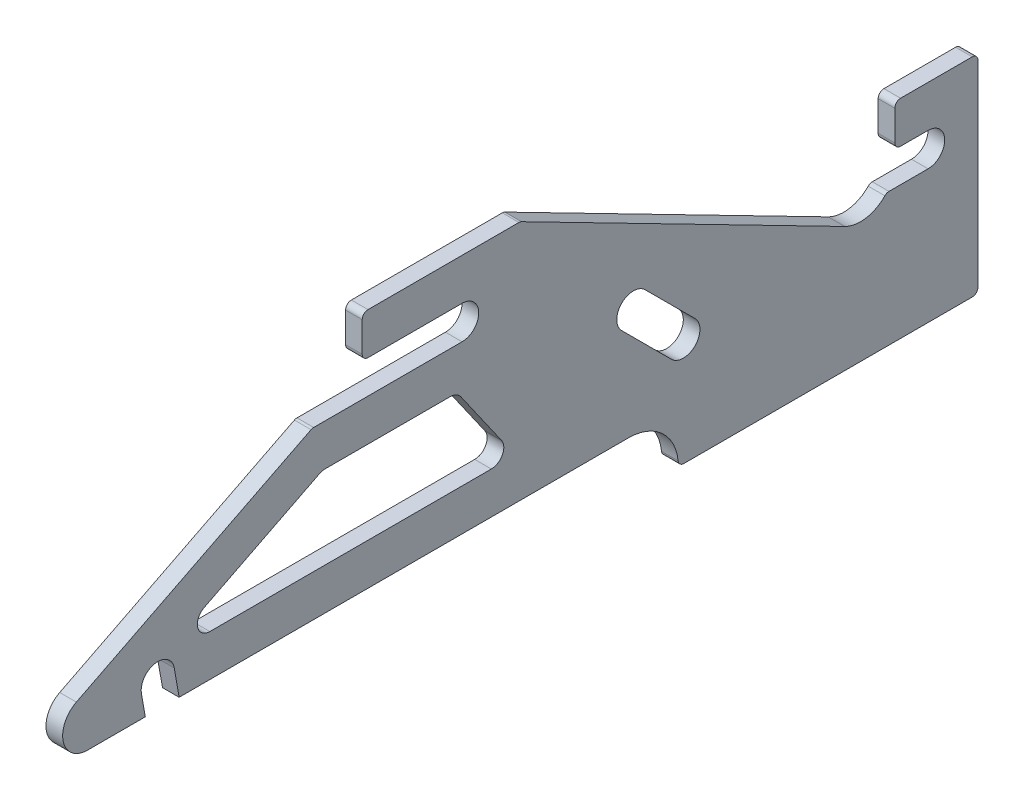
ISO-10303-21;
HEADER;
FILE_DESCRIPTION(('STEP AP214'),'2;1');
FILE_NAME('part.step','',(''),(''),'','','');
FILE_SCHEMA(('AUTOMOTIVE_DESIGN { 1 0 10303 214 1 1 1 1 }'));
ENDSEC;
DATA;
#1=APPLICATION_CONTEXT('core data for automotive mechanical design processes');
#2=APPLICATION_PROTOCOL_DEFINITION('international standard','automotive_design',2000,#1);
#3=PRODUCT_CONTEXT('',#1,'mechanical');
#4=PRODUCT('Part','Part','',(#3));
#5=PRODUCT_RELATED_PRODUCT_CATEGORY('part','',(#4));
#6=PRODUCT_DEFINITION_FORMATION('','',#4);
#7=PRODUCT_DEFINITION_CONTEXT('part definition',#1,'design');
#8=PRODUCT_DEFINITION('design','',#6,#7);
#9=PRODUCT_DEFINITION_SHAPE('','',#8);
#10=(LENGTH_UNIT() NAMED_UNIT(*) SI_UNIT(.MILLI.,.METRE.));
#11=(NAMED_UNIT(*) PLANE_ANGLE_UNIT() SI_UNIT($,.RADIAN.));
#12=(NAMED_UNIT(*) SI_UNIT($,.STERADIAN.) SOLID_ANGLE_UNIT());
#13=UNCERTAINTY_MEASURE_WITH_UNIT(LENGTH_MEASURE(1.E-05),#10,'distance_accuracy_value','');
#14=(GEOMETRIC_REPRESENTATION_CONTEXT(3) GLOBAL_UNCERTAINTY_ASSIGNED_CONTEXT((#13)) GLOBAL_UNIT_ASSIGNED_CONTEXT((#10,
#11,#12)) REPRESENTATION_CONTEXT('',''));
#15=CARTESIAN_POINT('',(0.,0.,0.));
#16=DIRECTION('',(0.,0.,1.));
#17=DIRECTION('',(1.,0.,0.));
#18=AXIS2_PLACEMENT_3D('',#15,#16,#17);
#19=CARTESIAN_POINT('',(2.,0.,42.));
#20=DIRECTION('',(1.,0.,0.));
#21=DIRECTION('',(0.,0.,-1.));
#22=AXIS2_PLACEMENT_3D('',#19,#20,#21);
#23=PLANE('',#22);
#24=CARTESIAN_POINT('',(2.,19.,41.4142135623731));
#25=DIRECTION('',(1.,0.,0.));
#26=DIRECTION('',(0.,0.,-1.));
#27=AXIS2_PLACEMENT_3D('',#24,#25,#26);
#28=CIRCLE('',#27,2.);
#29=CARTESIAN_POINT('',(2.,20.4142135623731,40.));
#30=VERTEX_POINT('',#29);
#31=CARTESIAN_POINT('',(2.,17.5857864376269,42.8284271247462));
#32=VERTEX_POINT('',#31);
#33=EDGE_CURVE('E47',#30,#32,#28,.T.);
#34=ORIENTED_EDGE('',*,*,#33,.F.);
#35=DIRECTION('',(0.,0.707106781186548,0.707106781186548));
#36=VECTOR('',#35,1.);
#37=CARTESIAN_POINT('',(2.,20.4142135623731,40.));
#38=LINE('',#37,#36);
#39=CARTESIAN_POINT('',(2.,14.4142135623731,34.));
#40=VERTEX_POINT('',#39);
#41=EDGE_CURVE('E331',#40,#30,#38,.T.);
#42=ORIENTED_EDGE('',*,*,#41,.F.);
#43=CARTESIAN_POINT('',(2.,13.,35.4142135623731));
#44=DIRECTION('',(1.,0.,0.));
#45=DIRECTION('',(0.,0.,-1.));
#46=AXIS2_PLACEMENT_3D('',#43,#44,#45);
#47=CIRCLE('',#46,2.);
#48=CARTESIAN_POINT('',(2.,11.5857864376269,36.8284271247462));
#49=VERTEX_POINT('',#48);
#50=EDGE_CURVE('E334',#49,#40,#47,.T.);
#51=ORIENTED_EDGE('',*,*,#50,.F.);
#52=DIRECTION('',(0.,-0.707106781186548,-0.707106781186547));
#53=VECTOR('',#52,1.);
#54=CARTESIAN_POINT('',(2.,17.5857864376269,42.8284271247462));
#55=LINE('',#54,#53);
#56=EDGE_CURVE('E340',#32,#49,#55,.T.);
#57=ORIENTED_EDGE('',*,*,#56,.F.);
#58=EDGE_LOOP('',(#34,#42,#51,#57));
#59=FACE_BOUND('',#58,.T.);
#60=CARTESIAN_POINT('',(2.,0.,42.));
#61=DIRECTION('',(-1.,0.,0.));
#62=DIRECTION('',(0.,0.,-1.));
#63=AXIS2_PLACEMENT_3D('',#60,#61,#62);
#64=CIRCLE('',#63,6.);
#65=CARTESIAN_POINT('',(2.,5.99999999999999,42.));
#66=VERTEX_POINT('',#65);
#67=CARTESIAN_POINT('',(2.,0.624001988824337,36.0325364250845));
#68=VERTEX_POINT('',#67);
#69=EDGE_CURVE('E409',#66,#68,#64,.T.);
#70=ORIENTED_EDGE('',*,*,#69,.T.);
#71=CARTESIAN_POINT('',(2.,0.696431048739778,35.3398819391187));
#72=DIRECTION('',(1.,0.,0.));
#73=DIRECTION('',(0.,0.,1.));
#74=AXIS2_PLACEMENT_3D('',#71,#72,#73);
#75=CIRCLE('',#74,0.696431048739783);
#76=CARTESIAN_POINT('',(2.,0.,35.3398819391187));
#77=VERTEX_POINT('',#76);
#78=EDGE_CURVE('E412',#68,#77,#75,.T.);
#79=ORIENTED_EDGE('',*,*,#78,.T.);
#80=DIRECTION('',(0.,0.,-1.));
#81=VECTOR('',#80,1.);
#82=CARTESIAN_POINT('',(2.,0.,0.696431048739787));
#83=LINE('',#82,#81);
#84=CARTESIAN_POINT('',(2.,0.,0.696431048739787));
#85=VERTEX_POINT('',#84);
#86=EDGE_CURVE('E415',#77,#85,#83,.T.);
#87=ORIENTED_EDGE('',*,*,#86,.T.);
#88=CARTESIAN_POINT('',(2.,0.696431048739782,0.696431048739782));
#89=DIRECTION('',(1.,0.,0.));
#90=DIRECTION('',(0.,0.,1.));
#91=AXIS2_PLACEMENT_3D('',#88,#89,#90);
#92=CIRCLE('',#91,0.696431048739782);
#93=CARTESIAN_POINT('',(2.,0.696431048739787,0.));
#94=VERTEX_POINT('',#93);
#95=EDGE_CURVE('E417',#85,#94,#92,.T.);
#96=ORIENTED_EDGE('',*,*,#95,.T.);
#97=DIRECTION('',(0.,1.,0.));
#98=VECTOR('',#97,1.);
#99=CARTESIAN_POINT('',(2.,24.3035689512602,0.));
#100=LINE('',#99,#98);
#101=CARTESIAN_POINT('',(2.,24.3035689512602,0.));
#102=VERTEX_POINT('',#101);
#103=EDGE_CURVE('E419',#94,#102,#100,.T.);
#104=ORIENTED_EDGE('',*,*,#103,.T.);
#105=CARTESIAN_POINT('',(2.,24.3035689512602,0.696431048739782));
#106=DIRECTION('',(1.,0.,0.));
#107=DIRECTION('',(0.,0.,-1.));
#108=AXIS2_PLACEMENT_3D('',#105,#106,#107);
#109=CIRCLE('',#108,0.696431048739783);
#110=CARTESIAN_POINT('',(2.,25.,0.696431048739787));
#111=VERTEX_POINT('',#110);
#112=EDGE_CURVE('E421',#102,#111,#109,.T.);
#113=ORIENTED_EDGE('',*,*,#112,.T.);
#114=DIRECTION('',(0.,0.,1.));
#115=VECTOR('',#114,1.);
#116=CARTESIAN_POINT('',(2.,25.,9.30356895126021));
#117=LINE('',#116,#115);
#118=CARTESIAN_POINT('',(2.,25.,9.30356895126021));
#119=VERTEX_POINT('',#118);
#120=EDGE_CURVE('E423',#111,#119,#117,.T.);
#121=ORIENTED_EDGE('',*,*,#120,.T.);
#122=CARTESIAN_POINT('',(2.,24.3035689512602,9.30356895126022));
#123=DIRECTION('',(1.,0.,0.));
#124=DIRECTION('',(0.,0.,1.));
#125=AXIS2_PLACEMENT_3D('',#122,#123,#124);
#126=CIRCLE('',#125,0.696431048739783);
#127=CARTESIAN_POINT('',(2.,24.3035689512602,10.));
#128=VERTEX_POINT('',#127);
#129=EDGE_CURVE('E425',#119,#128,#126,.T.);
#130=ORIENTED_EDGE('',*,*,#129,.T.);
#131=DIRECTION('',(0.,-1.,0.));
#132=VECTOR('',#131,1.);
#133=CARTESIAN_POINT('',(2.,20.6964310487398,10.));
#134=LINE('',#133,#132);
#135=CARTESIAN_POINT('',(2.,20.6964310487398,10.));
#136=VERTEX_POINT('',#135);
#137=EDGE_CURVE('E427',#128,#136,#134,.T.);
#138=ORIENTED_EDGE('',*,*,#137,.T.);
#139=CARTESIAN_POINT('',(2.,20.6964310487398,9.30356895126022));
#140=DIRECTION('',(1.,0.,0.));
#141=DIRECTION('',(0.,0.,1.));
#142=AXIS2_PLACEMENT_3D('',#139,#140,#141);
#143=CIRCLE('',#142,0.696431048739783);
#144=CARTESIAN_POINT('',(2.,20.,9.30356895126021));
#145=VERTEX_POINT('',#144);
#146=EDGE_CURVE('E429',#136,#145,#143,.T.);
#147=ORIENTED_EDGE('',*,*,#146,.T.);
#148=DIRECTION('',(0.,0.,-1.));
#149=VECTOR('',#148,1.);
#150=CARTESIAN_POINT('',(2.,20.,6.));
#151=LINE('',#150,#149);
#152=CARTESIAN_POINT('',(2.,20.,6.));
#153=VERTEX_POINT('',#152);
#154=EDGE_CURVE('E431',#145,#153,#151,.T.);
#155=ORIENTED_EDGE('',*,*,#154,.T.);
#156=CARTESIAN_POINT('',(2.,18.,6.));
#157=DIRECTION('',(-1.,0.,0.));
#158=DIRECTION('',(0.,0.,-1.));
#159=AXIS2_PLACEMENT_3D('',#156,#157,#158);
#160=CIRCLE('',#159,2.);
#161=CARTESIAN_POINT('',(2.,16.,6.));
#162=VERTEX_POINT('',#161);
#163=EDGE_CURVE('E433',#153,#162,#160,.T.);
#164=ORIENTED_EDGE('',*,*,#163,.T.);
#165=DIRECTION('',(0.,0.,1.));
#166=VECTOR('',#165,1.);
#167=CARTESIAN_POINT('',(2.,16.,10.6920990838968));
#168=LINE('',#167,#166);
#169=CARTESIAN_POINT('',(2.,16.,10.6920990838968));
#170=VERTEX_POINT('',#169);
#171=EDGE_CURVE('E435',#162,#170,#168,.T.);
#172=ORIENTED_EDGE('',*,*,#171,.T.);
#173=CARTESIAN_POINT('',(2.,15.3035689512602,10.6920990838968));
#174=DIRECTION('',(1.,0.,0.));
#175=DIRECTION('',(0.,0.,1.));
#176=AXIS2_PLACEMENT_3D('',#173,#174,#175);
#177=CIRCLE('',#176,0.696431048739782);
#178=CARTESIAN_POINT('',(2.,15.7891852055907,11.1912914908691));
#179=VERTEX_POINT('',#178);
#180=EDGE_CURVE('E437',#170,#179,#177,.T.);
#181=ORIENTED_EDGE('',*,*,#180,.T.);
#182=CARTESIAN_POINT('',(2.,18.6474820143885,14.1294964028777));
#183=DIRECTION('',(-1.,0.,0.));
#184=DIRECTION('',(0.,0.,-1.));
#185=AXIS2_PLACEMENT_3D('',#182,#183,#184);
#186=CIRCLE('',#185,4.09913512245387);
#187=CARTESIAN_POINT('',(2.,15.,16.));
#188=VERTEX_POINT('',#187);
#189=EDGE_CURVE('E439',#179,#188,#186,.T.);
#190=ORIENTED_EDGE('',*,*,#189,.T.);
#191=DIRECTION('',(0.,0.456316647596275,0.889817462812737));
#192=VECTOR('',#191,1.);
#193=CARTESIAN_POINT('',(2.,34.9232654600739,54.850367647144));
#194=LINE('',#193,#192);
#195=CARTESIAN_POINT('',(2.,34.9232654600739,54.850367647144));
#196=VERTEX_POINT('',#195);
#197=EDGE_CURVE('E441',#188,#196,#194,.T.);
#198=ORIENTED_EDGE('',*,*,#197,.T.);
#199=CARTESIAN_POINT('',(2.,34.3035689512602,55.1681607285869));
#200=DIRECTION('',(1.,0.,0.));
#201=DIRECTION('',(0.,0.,1.));
#202=AXIS2_PLACEMENT_3D('',#199,#200,#201);
#203=CIRCLE('',#202,0.696431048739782);
#204=CARTESIAN_POINT('',(2.,35.,55.1681607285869));
#205=VERTEX_POINT('',#204);
#206=EDGE_CURVE('E443',#196,#205,#203,.T.);
#207=ORIENTED_EDGE('',*,*,#206,.T.);
#208=DIRECTION('',(0.,0.,1.));
#209=VECTOR('',#208,1.);
#210=CARTESIAN_POINT('',(2.,35.,73.3035689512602));
#211=LINE('',#210,#209);
#212=CARTESIAN_POINT('',(2.,35.,73.3035689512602));
#213=VERTEX_POINT('',#212);
#214=EDGE_CURVE('E445',#205,#213,#211,.T.);
#215=ORIENTED_EDGE('',*,*,#214,.T.);
#216=CARTESIAN_POINT('',(2.,34.3035689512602,73.3035689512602));
#217=DIRECTION('',(1.,0.,0.));
#218=DIRECTION('',(0.,0.,1.));
#219=AXIS2_PLACEMENT_3D('',#216,#217,#218);
#220=CIRCLE('',#219,0.696431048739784);
#221=CARTESIAN_POINT('',(2.,34.3035689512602,74.));
#222=VERTEX_POINT('',#221);
#223=EDGE_CURVE('E447',#213,#222,#220,.T.);
#224=ORIENTED_EDGE('',*,*,#223,.T.);
#225=DIRECTION('',(0.,-1.,0.));
#226=VECTOR('',#225,1.);
#227=CARTESIAN_POINT('',(2.,30.6964310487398,74.));
#228=LINE('',#227,#226);
#229=CARTESIAN_POINT('',(2.,30.6964310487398,74.));
#230=VERTEX_POINT('',#229);
#231=EDGE_CURVE('E449',#222,#230,#228,.T.);
#232=ORIENTED_EDGE('',*,*,#231,.T.);
#233=CARTESIAN_POINT('',(2.,30.6964310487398,73.3035689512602));
#234=DIRECTION('',(1.,0.,0.));
#235=DIRECTION('',(0.,0.,1.));
#236=AXIS2_PLACEMENT_3D('',#233,#234,#235);
#237=CIRCLE('',#236,0.696431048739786);
#238=CARTESIAN_POINT('',(2.,30.,73.3035689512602));
#239=VERTEX_POINT('',#238);
#240=EDGE_CURVE('E451',#230,#239,#237,.T.);
#241=ORIENTED_EDGE('',*,*,#240,.T.);
#242=DIRECTION('',(0.,0.,-1.));
#243=VECTOR('',#242,1.);
#244=CARTESIAN_POINT('',(2.,30.,62.));
#245=LINE('',#244,#243);
#246=CARTESIAN_POINT('',(2.,30.,62.));
#247=VERTEX_POINT('',#246);
#248=EDGE_CURVE('E453',#239,#247,#245,.T.);
#249=ORIENTED_EDGE('',*,*,#248,.T.);
#250=CARTESIAN_POINT('',(2.,28.,62.));
#251=DIRECTION('',(-1.,0.,0.));
#252=DIRECTION('',(0.,0.,-1.));
#253=AXIS2_PLACEMENT_3D('',#250,#251,#252);
#254=CIRCLE('',#253,2.);
#255=CARTESIAN_POINT('',(2.,26.,62.));
#256=VERTEX_POINT('',#255);
#257=EDGE_CURVE('E455',#247,#256,#254,.T.);
#258=ORIENTED_EDGE('',*,*,#257,.T.);
#259=DIRECTION('',(0.,0.,1.));
#260=VECTOR('',#259,1.);
#261=CARTESIAN_POINT('',(2.,26.,79.8340836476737));
#262=LINE('',#261,#260);
#263=CARTESIAN_POINT('',(2.,26.,79.8340836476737));
#264=VERTEX_POINT('',#263);
#265=EDGE_CURVE('E457',#256,#264,#262,.T.);
#266=ORIENTED_EDGE('',*,*,#265,.T.);
#267=CARTESIAN_POINT('',(2.,25.3035689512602,79.8340836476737));
#268=DIRECTION('',(1.,0.,0.));
#269=DIRECTION('',(0.,0.,1.));
#270=AXIS2_PLACEMENT_3D('',#267,#268,#269);
#271=CIRCLE('',#270,0.696431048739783);
#272=CARTESIAN_POINT('',(2.,25.9251908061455,80.1480939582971));
#273=VERTEX_POINT('',#272);
#274=EDGE_CURVE('E459',#264,#273,#271,.T.);
#275=ORIENTED_EDGE('',*,*,#274,.T.);
#276=DIRECTION('',(0.,-0.450884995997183,0.892582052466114));
#277=VECTOR('',#276,1.);
#278=CARTESIAN_POINT('',(2.,11.6777461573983,108.352654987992));
#279=LINE('',#278,#277);
#280=CARTESIAN_POINT('',(2.,11.6777461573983,108.352654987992));
#281=VERTEX_POINT('',#280);
#282=EDGE_CURVE('E461',#273,#281,#279,.T.);
#283=ORIENTED_EDGE('',*,*,#282,.T.);
#284=CARTESIAN_POINT('',(2.,8.99999999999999,107.));
#285=DIRECTION('',(1.,0.,0.));
#286=DIRECTION('',(0.,0.,1.));
#287=AXIS2_PLACEMENT_3D('',#284,#285,#286);
#288=CIRCLE('',#287,3.);
#289=CARTESIAN_POINT('',(2.,5.99999999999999,107.));
#290=VERTEX_POINT('',#289);
#291=EDGE_CURVE('E463',#281,#290,#288,.T.);
#292=ORIENTED_EDGE('',*,*,#291,.T.);
#293=DIRECTION('',(0.,0.,-1.));
#294=VECTOR('',#293,1.);
#295=CARTESIAN_POINT('',(2.,5.99999999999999,100.061706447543));
#296=LINE('',#295,#294);
#297=CARTESIAN_POINT('',(2.,5.99999999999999,100.061706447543));
#298=VERTEX_POINT('',#297);
#299=EDGE_CURVE('E465',#290,#298,#296,.T.);
#300=ORIENTED_EDGE('',*,*,#299,.T.);
#301=DIRECTION('',(0.,0.984807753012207,0.173648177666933));
#302=VECTOR('',#301,1.);
#303=CARTESIAN_POINT('',(2.,8.65270364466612,100.529449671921));
#304=LINE('',#303,#302);
#305=CARTESIAN_POINT('',(2.,8.65270364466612,100.529449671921));
#306=VERTEX_POINT('',#305);
#307=EDGE_CURVE('E467',#298,#306,#304,.T.);
#308=ORIENTED_EDGE('',*,*,#307,.T.);
#309=CARTESIAN_POINT('',(2.,8.99999999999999,98.5598341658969));
#310=DIRECTION('',(-1.,0.,0.));
#311=DIRECTION('',(0.,0.,-1.));
#312=AXIS2_PLACEMENT_3D('',#309,#310,#311);
#313=CIRCLE('',#312,2.);
#314=CARTESIAN_POINT('',(2.,9.34729635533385,96.5902186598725));
#315=VERTEX_POINT('',#314);
#316=EDGE_CURVE('E469',#306,#315,#313,.T.);
#317=ORIENTED_EDGE('',*,*,#316,.T.);
#318=DIRECTION('',(0.,-0.984807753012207,-0.173648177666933));
#319=VECTOR('',#318,1.);
#320=CARTESIAN_POINT('',(2.,9.34729635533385,96.5902186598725));
#321=LINE('',#320,#319);
#322=CARTESIAN_POINT('',(2.,5.99999999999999,96.));
#323=VERTEX_POINT('',#322);
#324=EDGE_CURVE('E471',#315,#323,#321,.T.);
#325=ORIENTED_EDGE('',*,*,#324,.T.);
#326=DIRECTION('',(0.,0.,-1.));
#327=VECTOR('',#326,1.);
#328=CARTESIAN_POINT('',(2.,5.99999999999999,42.));
#329=LINE('',#328,#327);
#330=EDGE_CURVE('E473',#323,#66,#329,.T.);
#331=ORIENTED_EDGE('',*,*,#330,.T.);
#332=EDGE_LOOP('',(#70,#79,#87,#96,#104,#113,#121,#130,#138,#147,#155,#164,#172,#181,#190,#198,
#207,#215,#224,#232,#241,#249,#258,#266,#275,#283,#292,#300,#308,#317,#325,#331));
#333=FACE_BOUND('',#332,.T.);
#334=DIRECTION('',(0.,-0.450884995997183,0.892582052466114));
#335=VECTOR('',#334,1.);
#336=CARTESIAN_POINT('',(2.,20.8388730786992,79.1277803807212));
#337=LINE('',#336,#335);
#338=CARTESIAN_POINT('',(2.,20.8388730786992,79.1277803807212));
#339=VERTEX_POINT('',#338);
#340=CARTESIAN_POINT('',(2.,13.8388730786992,92.9851374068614));
#341=VERTEX_POINT('',#340);
#342=EDGE_CURVE('E352',#339,#341,#337,.T.);
#343=ORIENTED_EDGE('',*,*,#342,.F.);
#344=CARTESIAN_POINT('',(2.,19.5,78.4514528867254));
#345=DIRECTION('',(1.,0.,0.));
#346=DIRECTION('',(0.,0.,-1.));
#347=AXIS2_PLACEMENT_3D('',#344,#345,#346);
#348=CIRCLE('',#347,1.5);
#349=CARTESIAN_POINT('',(2.,21.,78.4514528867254));
#350=VERTEX_POINT('',#349);
#351=EDGE_CURVE('E350',#350,#339,#348,.T.);
#352=ORIENTED_EDGE('',*,*,#351,.F.);
#353=DIRECTION('',(0.,0.,1.));
#354=VECTOR('',#353,1.);
#355=CARTESIAN_POINT('',(2.,21.,63.3860175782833));
#356=LINE('',#355,#354);
#357=CARTESIAN_POINT('',(2.,21.,63.3860175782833));
#358=VERTEX_POINT('',#357);
#359=EDGE_CURVE('E366',#358,#350,#356,.T.);
#360=ORIENTED_EDGE('',*,*,#359,.F.);
#361=CARTESIAN_POINT('',(2.,19.5,63.3860175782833));
#362=DIRECTION('',(1.,0.,0.));
#363=DIRECTION('',(0.,0.,-1.));
#364=AXIS2_PLACEMENT_3D('',#361,#362,#363);
#365=CIRCLE('',#364,1.5);
#366=CARTESIAN_POINT('',(2.,20.360193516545,62.1571696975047));
#367=VERTEX_POINT('',#366);
#368=EDGE_CURVE('E363',#367,#358,#365,.T.);
#369=ORIENTED_EDGE('',*,*,#368,.F.);
#370=DIRECTION('',(0.,0.81923192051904,0.573462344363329));
#371=VECTOR('',#370,1.);
#372=CARTESIAN_POINT('',(2.,13.360193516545,57.2571696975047));
#373=LINE('',#372,#371);
#374=CARTESIAN_POINT('',(2.,13.360193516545,57.2571696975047));
#375=VERTEX_POINT('',#374);
#376=EDGE_CURVE('E361',#375,#367,#373,.T.);
#377=ORIENTED_EDGE('',*,*,#376,.F.);
#378=CARTESIAN_POINT('',(2.,12.5,58.4860175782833));
#379=DIRECTION('',(1.,0.,0.));
#380=DIRECTION('',(0.,0.,-1.));
#381=AXIS2_PLACEMENT_3D('',#378,#379,#380);
#382=CIRCLE('',#381,1.5);
#383=CARTESIAN_POINT('',(2.,11.,58.4860175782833));
#384=VERTEX_POINT('',#383);
#385=EDGE_CURVE('E359',#384,#375,#382,.T.);
#386=ORIENTED_EDGE('',*,*,#385,.F.);
#387=DIRECTION('',(0.,0.,-1.));
#388=VECTOR('',#387,1.);
#389=CARTESIAN_POINT('',(2.,11.,92.3088099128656));
#390=LINE('',#389,#388);
#391=CARTESIAN_POINT('',(2.,11.,92.3088099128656));
#392=VERTEX_POINT('',#391);
#393=EDGE_CURVE('E357',#392,#384,#390,.T.);
#394=ORIENTED_EDGE('',*,*,#393,.F.);
#395=CARTESIAN_POINT('',(2.,12.5,92.3088099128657));
#396=DIRECTION('',(1.,0.,0.));
#397=DIRECTION('',(0.,0.,1.));
#398=AXIS2_PLACEMENT_3D('',#395,#396,#397);
#399=CIRCLE('',#398,1.5);
#400=EDGE_CURVE('E355',#341,#392,#399,.T.);
#401=ORIENTED_EDGE('',*,*,#400,.F.);
#402=EDGE_LOOP('',(#343,#352,#360,#369,#377,#386,#394,#401));
#403=FACE_BOUND('',#402,.T.);
#404=ADVANCED_FACE('F32',(#59,#333,#403),#23,.T.);
#405=CARTESIAN_POINT('',(0.,0.,42.));
#406=DIRECTION('',(1.,0.,0.));
#407=DIRECTION('',(0.,0.,-1.));
#408=AXIS2_PLACEMENT_3D('',#405,#406,#407);
#409=PLANE('',#408);
#410=DIRECTION('',(0.,0.707106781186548,0.707106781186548));
#411=VECTOR('',#410,1.);
#412=CARTESIAN_POINT('',(0.,20.4142135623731,40.));
#413=LINE('',#412,#411);
#414=CARTESIAN_POINT('',(0.,14.4142135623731,34.));
#415=VERTEX_POINT('',#414);
#416=CARTESIAN_POINT('',(0.,20.4142135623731,40.));
#417=VERTEX_POINT('',#416);
#418=EDGE_CURVE('E321',#415,#417,#413,.T.);
#419=ORIENTED_EDGE('',*,*,#418,.T.);
#420=CARTESIAN_POINT('',(0.,19.,41.4142135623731));
#421=DIRECTION('',(1.,0.,0.));
#422=DIRECTION('',(0.,0.,-1.));
#423=AXIS2_PLACEMENT_3D('',#420,#421,#422);
#424=CIRCLE('',#423,2.);
#425=CARTESIAN_POINT('',(0.,17.5857864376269,42.8284271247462));
#426=VERTEX_POINT('',#425);
#427=EDGE_CURVE('E315',#417,#426,#424,.T.);
#428=ORIENTED_EDGE('',*,*,#427,.T.);
#429=DIRECTION('',(0.,-0.707106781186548,-0.707106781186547));
#430=VECTOR('',#429,1.);
#431=CARTESIAN_POINT('',(0.,17.5857864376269,42.8284271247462));
#432=LINE('',#431,#430);
#433=CARTESIAN_POINT('',(0.,11.5857864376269,36.8284271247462));
#434=VERTEX_POINT('',#433);
#435=EDGE_CURVE('E324',#426,#434,#432,.T.);
#436=ORIENTED_EDGE('',*,*,#435,.T.);
#437=CARTESIAN_POINT('',(0.,13.,35.4142135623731));
#438=DIRECTION('',(1.,0.,0.));
#439=DIRECTION('',(0.,0.,-1.));
#440=AXIS2_PLACEMENT_3D('',#437,#438,#439);
#441=CIRCLE('',#440,2.);
#442=EDGE_CURVE('E55',#434,#415,#441,.T.);
#443=ORIENTED_EDGE('',*,*,#442,.T.);
#444=EDGE_LOOP('',(#419,#428,#436,#443));
#445=FACE_BOUND('',#444,.T.);
#446=CARTESIAN_POINT('',(0.,0.,42.));
#447=DIRECTION('',(-1.,0.,0.));
#448=DIRECTION('',(0.,0.,-1.));
#449=AXIS2_PLACEMENT_3D('',#446,#447,#448);
#450=CIRCLE('',#449,6.);
#451=CARTESIAN_POINT('',(0.,5.99999999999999,42.));
#452=VERTEX_POINT('',#451);
#453=CARTESIAN_POINT('',(0.,0.624001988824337,36.0325364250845));
#454=VERTEX_POINT('',#453);
#455=EDGE_CURVE('E408',#452,#454,#450,.T.);
#456=ORIENTED_EDGE('',*,*,#455,.F.);
#457=DIRECTION('',(0.,0.,-1.));
#458=VECTOR('',#457,1.);
#459=CARTESIAN_POINT('',(0.,5.99999999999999,42.));
#460=LINE('',#459,#458);
#461=CARTESIAN_POINT('',(0.,5.99999999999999,96.));
#462=VERTEX_POINT('',#461);
#463=EDGE_CURVE('E413',#462,#452,#460,.T.);
#464=ORIENTED_EDGE('',*,*,#463,.F.);
#465=DIRECTION('',(0.,-0.984807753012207,-0.173648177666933));
#466=VECTOR('',#465,1.);
#467=CARTESIAN_POINT('',(0.,9.34729635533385,96.5902186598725));
#468=LINE('',#467,#466);
#469=CARTESIAN_POINT('',(0.,9.34729635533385,96.5902186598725));
#470=VERTEX_POINT('',#469);
#471=EDGE_CURVE('E536',#470,#462,#468,.T.);
#472=ORIENTED_EDGE('',*,*,#471,.F.);
#473=CARTESIAN_POINT('',(0.,8.99999999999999,98.5598341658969));
#474=DIRECTION('',(-1.,0.,0.));
#475=DIRECTION('',(0.,0.,-1.));
#476=AXIS2_PLACEMENT_3D('',#473,#474,#475);
#477=CIRCLE('',#476,2.);
#478=CARTESIAN_POINT('',(0.,8.65270364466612,100.529449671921));
#479=VERTEX_POINT('',#478);
#480=EDGE_CURVE('E534',#479,#470,#477,.T.);
#481=ORIENTED_EDGE('',*,*,#480,.F.);
#482=DIRECTION('',(0.,0.984807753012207,0.173648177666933));
#483=VECTOR('',#482,1.);
#484=CARTESIAN_POINT('',(0.,8.65270364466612,100.529449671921));
#485=LINE('',#484,#483);
#486=CARTESIAN_POINT('',(0.,5.99999999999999,100.061706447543));
#487=VERTEX_POINT('',#486);
#488=EDGE_CURVE('E532',#487,#479,#485,.T.);
#489=ORIENTED_EDGE('',*,*,#488,.F.);
#490=DIRECTION('',(0.,0.,-1.));
#491=VECTOR('',#490,1.);
#492=CARTESIAN_POINT('',(0.,5.99999999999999,100.061706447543));
#493=LINE('',#492,#491);
#494=CARTESIAN_POINT('',(0.,5.99999999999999,107.));
#495=VERTEX_POINT('',#494);
#496=EDGE_CURVE('E530',#495,#487,#493,.T.);
#497=ORIENTED_EDGE('',*,*,#496,.F.);
#498=CARTESIAN_POINT('',(0.,8.99999999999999,107.));
#499=DIRECTION('',(1.,0.,0.));
#500=DIRECTION('',(0.,0.,1.));
#501=AXIS2_PLACEMENT_3D('',#498,#499,#500);
#502=CIRCLE('',#501,3.);
#503=CARTESIAN_POINT('',(0.,11.6777461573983,108.352654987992));
#504=VERTEX_POINT('',#503);
#505=EDGE_CURVE('E528',#504,#495,#502,.T.);
#506=ORIENTED_EDGE('',*,*,#505,.F.);
#507=DIRECTION('',(0.,-0.450884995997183,0.892582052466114));
#508=VECTOR('',#507,1.);
#509=CARTESIAN_POINT('',(0.,11.6777461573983,108.352654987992));
#510=LINE('',#509,#508);
#511=CARTESIAN_POINT('',(0.,25.9251908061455,80.1480939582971));
#512=VERTEX_POINT('',#511);
#513=EDGE_CURVE('E526',#512,#504,#510,.T.);
#514=ORIENTED_EDGE('',*,*,#513,.F.);
#515=CARTESIAN_POINT('',(0.,25.3035689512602,79.8340836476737));
#516=DIRECTION('',(1.,0.,0.));
#517=DIRECTION('',(0.,0.,1.));
#518=AXIS2_PLACEMENT_3D('',#515,#516,#517);
#519=CIRCLE('',#518,0.696431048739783);
#520=CARTESIAN_POINT('',(0.,26.,79.8340836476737));
#521=VERTEX_POINT('',#520);
#522=EDGE_CURVE('E524',#521,#512,#519,.T.);
#523=ORIENTED_EDGE('',*,*,#522,.F.);
#524=DIRECTION('',(0.,0.,1.));
#525=VECTOR('',#524,1.);
#526=CARTESIAN_POINT('',(0.,26.,79.8340836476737));
#527=LINE('',#526,#525);
#528=CARTESIAN_POINT('',(0.,26.,62.));
#529=VERTEX_POINT('',#528);
#530=EDGE_CURVE('E522',#529,#521,#527,.T.);
#531=ORIENTED_EDGE('',*,*,#530,.F.);
#532=CARTESIAN_POINT('',(0.,28.,62.));
#533=DIRECTION('',(-1.,0.,0.));
#534=DIRECTION('',(0.,0.,-1.));
#535=AXIS2_PLACEMENT_3D('',#532,#533,#534);
#536=CIRCLE('',#535,2.);
#537=CARTESIAN_POINT('',(0.,30.,62.));
#538=VERTEX_POINT('',#537);
#539=EDGE_CURVE('E520',#538,#529,#536,.T.);
#540=ORIENTED_EDGE('',*,*,#539,.F.);
#541=DIRECTION('',(0.,0.,-1.));
#542=VECTOR('',#541,1.);
#543=CARTESIAN_POINT('',(0.,30.,62.));
#544=LINE('',#543,#542);
#545=CARTESIAN_POINT('',(0.,30.,73.3035689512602));
#546=VERTEX_POINT('',#545);
#547=EDGE_CURVE('E518',#546,#538,#544,.T.);
#548=ORIENTED_EDGE('',*,*,#547,.F.);
#549=CARTESIAN_POINT('',(0.,30.6964310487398,73.3035689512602));
#550=DIRECTION('',(1.,0.,0.));
#551=DIRECTION('',(0.,0.,1.));
#552=AXIS2_PLACEMENT_3D('',#549,#550,#551);
#553=CIRCLE('',#552,0.696431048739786);
#554=CARTESIAN_POINT('',(0.,30.6964310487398,74.));
#555=VERTEX_POINT('',#554);
#556=EDGE_CURVE('E516',#555,#546,#553,.T.);
#557=ORIENTED_EDGE('',*,*,#556,.F.);
#558=DIRECTION('',(0.,-1.,0.));
#559=VECTOR('',#558,1.);
#560=CARTESIAN_POINT('',(0.,30.6964310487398,74.));
#561=LINE('',#560,#559);
#562=CARTESIAN_POINT('',(0.,34.3035689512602,74.));
#563=VERTEX_POINT('',#562);
#564=EDGE_CURVE('E514',#563,#555,#561,.T.);
#565=ORIENTED_EDGE('',*,*,#564,.F.);
#566=CARTESIAN_POINT('',(0.,34.3035689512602,73.3035689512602));
#567=DIRECTION('',(1.,0.,0.));
#568=DIRECTION('',(0.,0.,1.));
#569=AXIS2_PLACEMENT_3D('',#566,#567,#568);
#570=CIRCLE('',#569,0.696431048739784);
#571=CARTESIAN_POINT('',(0.,35.,73.3035689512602));
#572=VERTEX_POINT('',#571);
#573=EDGE_CURVE('E512',#572,#563,#570,.T.);
#574=ORIENTED_EDGE('',*,*,#573,.F.);
#575=DIRECTION('',(0.,0.,1.));
#576=VECTOR('',#575,1.);
#577=CARTESIAN_POINT('',(0.,35.,73.3035689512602));
#578=LINE('',#577,#576);
#579=CARTESIAN_POINT('',(0.,35.,55.1681607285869));
#580=VERTEX_POINT('',#579);
#581=EDGE_CURVE('E510',#580,#572,#578,.T.);
#582=ORIENTED_EDGE('',*,*,#581,.F.);
#583=CARTESIAN_POINT('',(0.,34.3035689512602,55.1681607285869));
#584=DIRECTION('',(1.,0.,0.));
#585=DIRECTION('',(0.,0.,1.));
#586=AXIS2_PLACEMENT_3D('',#583,#584,#585);
#587=CIRCLE('',#586,0.696431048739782);
#588=CARTESIAN_POINT('',(0.,34.9232654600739,54.850367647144));
#589=VERTEX_POINT('',#588);
#590=EDGE_CURVE('E508',#589,#580,#587,.T.);
#591=ORIENTED_EDGE('',*,*,#590,.F.);
#592=DIRECTION('',(0.,0.456316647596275,0.889817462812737));
#593=VECTOR('',#592,1.);
#594=CARTESIAN_POINT('',(0.,34.9232654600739,54.850367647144));
#595=LINE('',#594,#593);
#596=CARTESIAN_POINT('',(0.,15.,16.));
#597=VERTEX_POINT('',#596);
#598=EDGE_CURVE('E506',#597,#589,#595,.T.);
#599=ORIENTED_EDGE('',*,*,#598,.F.);
#600=CARTESIAN_POINT('',(0.,18.6474820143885,14.1294964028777));
#601=DIRECTION('',(-1.,0.,0.));
#602=DIRECTION('',(0.,0.,-1.));
#603=AXIS2_PLACEMENT_3D('',#600,#601,#602);
#604=CIRCLE('',#603,4.09913512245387);
#605=CARTESIAN_POINT('',(0.,15.7891852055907,11.1912914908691));
#606=VERTEX_POINT('',#605);
#607=EDGE_CURVE('E504',#606,#597,#604,.T.);
#608=ORIENTED_EDGE('',*,*,#607,.F.);
#609=CARTESIAN_POINT('',(0.,15.3035689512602,10.6920990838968));
#610=DIRECTION('',(1.,0.,0.));
#611=DIRECTION('',(0.,0.,1.));
#612=AXIS2_PLACEMENT_3D('',#609,#610,#611);
#613=CIRCLE('',#612,0.696431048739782);
#614=CARTESIAN_POINT('',(0.,16.,10.6920990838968));
#615=VERTEX_POINT('',#614);
#616=EDGE_CURVE('E502',#615,#606,#613,.T.);
#617=ORIENTED_EDGE('',*,*,#616,.F.);
#618=DIRECTION('',(0.,0.,1.));
#619=VECTOR('',#618,1.);
#620=CARTESIAN_POINT('',(0.,16.,10.6920990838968));
#621=LINE('',#620,#619);
#622=CARTESIAN_POINT('',(0.,16.,6.));
#623=VERTEX_POINT('',#622);
#624=EDGE_CURVE('E500',#623,#615,#621,.T.);
#625=ORIENTED_EDGE('',*,*,#624,.F.);
#626=CARTESIAN_POINT('',(0.,18.,6.));
#627=DIRECTION('',(-1.,0.,0.));
#628=DIRECTION('',(0.,0.,-1.));
#629=AXIS2_PLACEMENT_3D('',#626,#627,#628);
#630=CIRCLE('',#629,2.);
#631=CARTESIAN_POINT('',(0.,20.,6.));
#632=VERTEX_POINT('',#631);
#633=EDGE_CURVE('E498',#632,#623,#630,.T.);
#634=ORIENTED_EDGE('',*,*,#633,.F.);
#635=DIRECTION('',(0.,0.,-1.));
#636=VECTOR('',#635,1.);
#637=CARTESIAN_POINT('',(0.,20.,6.));
#638=LINE('',#637,#636);
#639=CARTESIAN_POINT('',(0.,20.,9.30356895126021));
#640=VERTEX_POINT('',#639);
#641=EDGE_CURVE('E496',#640,#632,#638,.T.);
#642=ORIENTED_EDGE('',*,*,#641,.F.);
#643=CARTESIAN_POINT('',(0.,20.6964310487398,9.30356895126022));
#644=DIRECTION('',(1.,0.,0.));
#645=DIRECTION('',(0.,0.,1.));
#646=AXIS2_PLACEMENT_3D('',#643,#644,#645);
#647=CIRCLE('',#646,0.696431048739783);
#648=CARTESIAN_POINT('',(0.,20.6964310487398,10.));
#649=VERTEX_POINT('',#648);
#650=EDGE_CURVE('E494',#649,#640,#647,.T.);
#651=ORIENTED_EDGE('',*,*,#650,.F.);
#652=DIRECTION('',(0.,-1.,0.));
#653=VECTOR('',#652,1.);
#654=CARTESIAN_POINT('',(0.,20.6964310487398,10.));
#655=LINE('',#654,#653);
#656=CARTESIAN_POINT('',(0.,24.3035689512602,10.));
#657=VERTEX_POINT('',#656);
#658=EDGE_CURVE('E492',#657,#649,#655,.T.);
#659=ORIENTED_EDGE('',*,*,#658,.F.);
#660=CARTESIAN_POINT('',(0.,24.3035689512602,9.30356895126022));
#661=DIRECTION('',(1.,0.,0.));
#662=DIRECTION('',(0.,0.,1.));
#663=AXIS2_PLACEMENT_3D('',#660,#661,#662);
#664=CIRCLE('',#663,0.696431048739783);
#665=CARTESIAN_POINT('',(0.,25.,9.30356895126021));
#666=VERTEX_POINT('',#665);
#667=EDGE_CURVE('E490',#666,#657,#664,.T.);
#668=ORIENTED_EDGE('',*,*,#667,.F.);
#669=DIRECTION('',(0.,0.,1.));
#670=VECTOR('',#669,1.);
#671=CARTESIAN_POINT('',(0.,25.,9.30356895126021));
#672=LINE('',#671,#670);
#673=CARTESIAN_POINT('',(0.,25.,0.696431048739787));
#674=VERTEX_POINT('',#673);
#675=EDGE_CURVE('E488',#674,#666,#672,.T.);
#676=ORIENTED_EDGE('',*,*,#675,.F.);
#677=CARTESIAN_POINT('',(0.,24.3035689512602,0.696431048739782));
#678=DIRECTION('',(1.,0.,0.));
#679=DIRECTION('',(0.,0.,-1.));
#680=AXIS2_PLACEMENT_3D('',#677,#678,#679);
#681=CIRCLE('',#680,0.696431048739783);
#682=CARTESIAN_POINT('',(0.,24.3035689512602,0.));
#683=VERTEX_POINT('',#682);
#684=EDGE_CURVE('E486',#683,#674,#681,.T.);
#685=ORIENTED_EDGE('',*,*,#684,.F.);
#686=DIRECTION('',(0.,1.,0.));
#687=VECTOR('',#686,1.);
#688=CARTESIAN_POINT('',(0.,24.3035689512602,0.));
#689=LINE('',#688,#687);
#690=CARTESIAN_POINT('',(0.,0.696431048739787,0.));
#691=VERTEX_POINT('',#690);
#692=EDGE_CURVE('E484',#691,#683,#689,.T.);
#693=ORIENTED_EDGE('',*,*,#692,.F.);
#694=CARTESIAN_POINT('',(0.,0.696431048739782,0.696431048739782));
#695=DIRECTION('',(1.,0.,0.));
#696=DIRECTION('',(0.,0.,1.));
#697=AXIS2_PLACEMENT_3D('',#694,#695,#696);
#698=CIRCLE('',#697,0.696431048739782);
#699=CARTESIAN_POINT('',(0.,0.,0.696431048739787));
#700=VERTEX_POINT('',#699);
#701=EDGE_CURVE('E482',#700,#691,#698,.T.);
#702=ORIENTED_EDGE('',*,*,#701,.F.);
#703=DIRECTION('',(0.,0.,-1.));
#704=VECTOR('',#703,1.);
#705=CARTESIAN_POINT('',(0.,0.,0.696431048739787));
#706=LINE('',#705,#704);
#707=CARTESIAN_POINT('',(0.,0.,35.3398819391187));
#708=VERTEX_POINT('',#707);
#709=EDGE_CURVE('E480',#708,#700,#706,.T.);
#710=ORIENTED_EDGE('',*,*,#709,.F.);
#711=CARTESIAN_POINT('',(0.,0.696431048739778,35.3398819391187));
#712=DIRECTION('',(1.,0.,0.));
#713=DIRECTION('',(0.,0.,1.));
#714=AXIS2_PLACEMENT_3D('',#711,#712,#713);
#715=CIRCLE('',#714,0.696431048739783);
#716=EDGE_CURVE('E478',#454,#708,#715,.T.);
#717=ORIENTED_EDGE('',*,*,#716,.F.);
#718=EDGE_LOOP('',(#456,#464,#472,#481,#489,#497,#506,#514,#523,#531,#540,#548,#557,#565,#574,
#582,#591,#599,#608,#617,#625,#634,#642,#651,#659,#668,#676,#685,#693,#702,#710,#717));
#719=FACE_BOUND('',#718,.T.);
#720=CARTESIAN_POINT('',(0.,19.5,78.4514528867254));
#721=DIRECTION('',(1.,0.,0.));
#722=DIRECTION('',(0.,0.,-1.));
#723=AXIS2_PLACEMENT_3D('',#720,#721,#722);
#724=CIRCLE('',#723,1.5);
#725=CARTESIAN_POINT('',(0.,21.,78.4514528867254));
#726=VERTEX_POINT('',#725);
#727=CARTESIAN_POINT('',(0.,20.8388730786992,79.1277803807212));
#728=VERTEX_POINT('',#727);
#729=EDGE_CURVE('E346',#726,#728,#724,.T.);
#730=ORIENTED_EDGE('',*,*,#729,.T.);
#731=DIRECTION('',(0.,-0.450884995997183,0.892582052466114));
#732=VECTOR('',#731,1.);
#733=CARTESIAN_POINT('',(0.,20.8388730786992,79.1277803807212));
#734=LINE('',#733,#732);
#735=CARTESIAN_POINT('',(0.,13.8388730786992,92.9851374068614));
#736=VERTEX_POINT('',#735);
#737=EDGE_CURVE('E371',#728,#736,#734,.T.);
#738=ORIENTED_EDGE('',*,*,#737,.T.);
#739=CARTESIAN_POINT('',(0.,12.5,92.3088099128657));
#740=DIRECTION('',(1.,0.,0.));
#741=DIRECTION('',(0.,0.,1.));
#742=AXIS2_PLACEMENT_3D('',#739,#740,#741);
#743=CIRCLE('',#742,1.5);
#744=CARTESIAN_POINT('',(0.,11.,92.3088099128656));
#745=VERTEX_POINT('',#744);
#746=EDGE_CURVE('E374',#736,#745,#743,.T.);
#747=ORIENTED_EDGE('',*,*,#746,.T.);
#748=DIRECTION('',(0.,0.,-1.));
#749=VECTOR('',#748,1.);
#750=CARTESIAN_POINT('',(0.,11.,92.3088099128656));
#751=LINE('',#750,#749);
#752=CARTESIAN_POINT('',(0.,11.,58.4860175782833));
#753=VERTEX_POINT('',#752);
#754=EDGE_CURVE('E377',#745,#753,#751,.T.);
#755=ORIENTED_EDGE('',*,*,#754,.T.);
#756=CARTESIAN_POINT('',(0.,12.5,58.4860175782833));
#757=DIRECTION('',(1.,0.,0.));
#758=DIRECTION('',(0.,0.,-1.));
#759=AXIS2_PLACEMENT_3D('',#756,#757,#758);
#760=CIRCLE('',#759,1.5);
#761=CARTESIAN_POINT('',(0.,13.360193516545,57.2571696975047));
#762=VERTEX_POINT('',#761);
#763=EDGE_CURVE('E380',#753,#762,#760,.T.);
#764=ORIENTED_EDGE('',*,*,#763,.T.);
#765=DIRECTION('',(0.,0.81923192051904,0.573462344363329));
#766=VECTOR('',#765,1.);
#767=CARTESIAN_POINT('',(0.,13.360193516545,57.2571696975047));
#768=LINE('',#767,#766);
#769=CARTESIAN_POINT('',(0.,20.360193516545,62.1571696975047));
#770=VERTEX_POINT('',#769);
#771=EDGE_CURVE('E383',#762,#770,#768,.T.);
#772=ORIENTED_EDGE('',*,*,#771,.T.);
#773=CARTESIAN_POINT('',(0.,19.5,63.3860175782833));
#774=DIRECTION('',(1.,0.,0.));
#775=DIRECTION('',(0.,0.,-1.));
#776=AXIS2_PLACEMENT_3D('',#773,#774,#775);
#777=CIRCLE('',#776,1.5);
#778=CARTESIAN_POINT('',(0.,21.,63.3860175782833));
#779=VERTEX_POINT('',#778);
#780=EDGE_CURVE('E386',#770,#779,#777,.T.);
#781=ORIENTED_EDGE('',*,*,#780,.T.);
#782=DIRECTION('',(0.,0.,1.));
#783=VECTOR('',#782,1.);
#784=CARTESIAN_POINT('',(0.,21.,63.3860175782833));
#785=LINE('',#784,#783);
#786=EDGE_CURVE('E353',#779,#726,#785,.T.);
#787=ORIENTED_EDGE('',*,*,#786,.T.);
#788=EDGE_LOOP('',(#730,#738,#747,#755,#764,#772,#781,#787));
#789=FACE_BOUND('',#788,.T.);
#790=ADVANCED_FACE('F328',(#445,#719,#789),#409,.F.);
#791=CARTESIAN_POINT('',(2.,0.,42.));
#792=DIRECTION('',(-1.,0.,0.));
#793=DIRECTION('',(0.,0.,1.));
#794=AXIS2_PLACEMENT_3D('',#791,#792,#793);
#795=CYLINDRICAL_SURFACE('',#794,6.);
#796=ORIENTED_EDGE('',*,*,#455,.T.);
#797=DIRECTION('',(-1.,0.,0.));
#798=VECTOR('',#797,1.);
#799=CARTESIAN_POINT('',(2.,0.624001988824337,36.0325364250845));
#800=LINE('',#799,#798);
#801=EDGE_CURVE('E11',#68,#454,#800,.T.);
#802=ORIENTED_EDGE('',*,*,#801,.F.);
#803=ORIENTED_EDGE('',*,*,#69,.F.);
#804=DIRECTION('',(-1.,0.,0.));
#805=VECTOR('',#804,1.);
#806=CARTESIAN_POINT('',(2.,5.99999999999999,42.));
#807=LINE('',#806,#805);
#808=EDGE_CURVE('E475',#66,#452,#807,.T.);
#809=ORIENTED_EDGE('',*,*,#808,.T.);
#810=EDGE_LOOP('',(#796,#802,#803,#809));
#811=FACE_BOUND('',#810,.T.);
#812=ADVANCED_FACE('F34',(#811),#795,.F.);
#813=CARTESIAN_POINT('',(2.,0.696431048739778,35.3398819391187));
#814=DIRECTION('',(-1.,0.,0.));
#815=DIRECTION('',(0.,0.,1.));
#816=AXIS2_PLACEMENT_3D('',#813,#814,#815);
#817=CYLINDRICAL_SURFACE('',#816,0.696431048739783);
#818=ORIENTED_EDGE('',*,*,#716,.T.);
#819=DIRECTION('',(-1.,0.,0.));
#820=VECTOR('',#819,1.);
#821=CARTESIAN_POINT('',(2.,0.,35.3398819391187));
#822=LINE('',#821,#820);
#823=EDGE_CURVE('E40',#77,#708,#822,.T.);
#824=ORIENTED_EDGE('',*,*,#823,.F.);
#825=ORIENTED_EDGE('',*,*,#78,.F.);
#826=ORIENTED_EDGE('',*,*,#801,.T.);
#827=EDGE_LOOP('',(#818,#824,#825,#826));
#828=FACE_BOUND('',#827,.T.);
#829=ADVANCED_FACE('F654',(#828),#817,.T.);
#830=CARTESIAN_POINT('',(2.,0.,0.696431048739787));
#831=DIRECTION('',(0.,1.,0.));
#832=DIRECTION('',(0.,0.,1.));
#833=AXIS2_PLACEMENT_3D('',#830,#831,#832);
#834=PLANE('',#833);
#835=ORIENTED_EDGE('',*,*,#709,.T.);
#836=DIRECTION('',(-1.,0.,0.));
#837=VECTOR('',#836,1.);
#838=CARTESIAN_POINT('',(2.,0.,0.696431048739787));
#839=LINE('',#838,#837);
#840=EDGE_CURVE('E625',#85,#700,#839,.T.);
#841=ORIENTED_EDGE('',*,*,#840,.F.);
#842=ORIENTED_EDGE('',*,*,#86,.F.);
#843=ORIENTED_EDGE('',*,*,#823,.T.);
#844=EDGE_LOOP('',(#835,#841,#842,#843));
#845=FACE_BOUND('',#844,.T.);
#846=ADVANCED_FACE('F632',(#845),#834,.F.);
#847=CARTESIAN_POINT('',(2.,0.696431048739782,0.696431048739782));
#848=DIRECTION('',(-1.,0.,0.));
#849=DIRECTION('',(0.,0.,1.));
#850=AXIS2_PLACEMENT_3D('',#847,#848,#849);
#851=CYLINDRICAL_SURFACE('',#850,0.696431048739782);
#852=ORIENTED_EDGE('',*,*,#701,.T.);
#853=DIRECTION('',(-1.,0.,0.));
#854=VECTOR('',#853,1.);
#855=CARTESIAN_POINT('',(2.,0.696431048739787,0.));
#856=LINE('',#855,#854);
#857=EDGE_CURVE('E622',#94,#691,#856,.T.);
#858=ORIENTED_EDGE('',*,*,#857,.F.);
#859=ORIENTED_EDGE('',*,*,#95,.F.);
#860=ORIENTED_EDGE('',*,*,#840,.T.);
#861=EDGE_LOOP('',(#852,#858,#859,#860));
#862=FACE_BOUND('',#861,.T.);
#863=ADVANCED_FACE('F642',(#862),#851,.T.);
#864=CARTESIAN_POINT('',(2.,24.3035689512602,0.));
#865=DIRECTION('',(0.,0.,1.));
#866=DIRECTION('',(1.,0.,0.));
#867=AXIS2_PLACEMENT_3D('',#864,#865,#866);
#868=PLANE('',#867);
#869=ORIENTED_EDGE('',*,*,#692,.T.);
#870=DIRECTION('',(-1.,0.,0.));
#871=VECTOR('',#870,1.);
#872=CARTESIAN_POINT('',(2.,24.3035689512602,0.));
#873=LINE('',#872,#871);
#874=EDGE_CURVE('E619',#102,#683,#873,.T.);
#875=ORIENTED_EDGE('',*,*,#874,.F.);
#876=ORIENTED_EDGE('',*,*,#103,.F.);
#877=ORIENTED_EDGE('',*,*,#857,.T.);
#878=EDGE_LOOP('',(#869,#875,#876,#877));
#879=FACE_BOUND('',#878,.T.);
#880=ADVANCED_FACE('F646',(#879),#868,.F.);
#881=CARTESIAN_POINT('',(2.,24.3035689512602,0.696431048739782));
#882=DIRECTION('',(-1.,0.,0.));
#883=DIRECTION('',(0.,0.,1.));
#884=AXIS2_PLACEMENT_3D('',#881,#882,#883);
#885=CYLINDRICAL_SURFACE('',#884,0.696431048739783);
#886=ORIENTED_EDGE('',*,*,#684,.T.);
#887=DIRECTION('',(-1.,0.,0.));
#888=VECTOR('',#887,1.);
#889=CARTESIAN_POINT('',(2.,25.,0.696431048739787));
#890=LINE('',#889,#888);
#891=EDGE_CURVE('E616',#111,#674,#890,.T.);
#892=ORIENTED_EDGE('',*,*,#891,.F.);
#893=ORIENTED_EDGE('',*,*,#112,.F.);
#894=ORIENTED_EDGE('',*,*,#874,.T.);
#895=EDGE_LOOP('',(#886,#892,#893,#894));
#896=FACE_BOUND('',#895,.T.);
#897=ADVANCED_FACE('F787',(#896),#885,.T.);
#898=CARTESIAN_POINT('',(2.,25.,9.30356895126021));
#899=DIRECTION('',(0.,-1.,0.));
#900=DIRECTION('',(0.,0.,-1.));
#901=AXIS2_PLACEMENT_3D('',#898,#899,#900);
#902=PLANE('',#901);
#903=ORIENTED_EDGE('',*,*,#675,.T.);
#904=DIRECTION('',(-1.,0.,0.));
#905=VECTOR('',#904,1.);
#906=CARTESIAN_POINT('',(2.,25.,9.30356895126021));
#907=LINE('',#906,#905);
#908=EDGE_CURVE('E613',#119,#666,#907,.T.);
#909=ORIENTED_EDGE('',*,*,#908,.F.);
#910=ORIENTED_EDGE('',*,*,#120,.F.);
#911=ORIENTED_EDGE('',*,*,#891,.T.);
#912=EDGE_LOOP('',(#903,#909,#910,#911));
#913=FACE_BOUND('',#912,.T.);
#914=ADVANCED_FACE('F785',(#913),#902,.F.);
#915=CARTESIAN_POINT('',(2.,24.3035689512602,9.30356895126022));
#916=DIRECTION('',(-1.,0.,0.));
#917=DIRECTION('',(0.,0.,1.));
#918=AXIS2_PLACEMENT_3D('',#915,#916,#917);
#919=CYLINDRICAL_SURFACE('',#918,0.696431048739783);
#920=ORIENTED_EDGE('',*,*,#667,.T.);
#921=DIRECTION('',(-1.,0.,0.));
#922=VECTOR('',#921,1.);
#923=CARTESIAN_POINT('',(2.,24.3035689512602,10.));
#924=LINE('',#923,#922);
#925=EDGE_CURVE('E610',#128,#657,#924,.T.);
#926=ORIENTED_EDGE('',*,*,#925,.F.);
#927=ORIENTED_EDGE('',*,*,#129,.F.);
#928=ORIENTED_EDGE('',*,*,#908,.T.);
#929=EDGE_LOOP('',(#920,#926,#927,#928));
#930=FACE_BOUND('',#929,.T.);
#931=ADVANCED_FACE('F780',(#930),#919,.T.);
#932=CARTESIAN_POINT('',(2.,20.6964310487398,10.));
#933=DIRECTION('',(0.,0.,-1.));
#934=DIRECTION('',(0.,1.,0.));
#935=AXIS2_PLACEMENT_3D('',#932,#933,#934);
#936=PLANE('',#935);
#937=ORIENTED_EDGE('',*,*,#658,.T.);
#938=DIRECTION('',(-1.,0.,0.));
#939=VECTOR('',#938,1.);
#940=CARTESIAN_POINT('',(2.,20.6964310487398,10.));
#941=LINE('',#940,#939);
#942=EDGE_CURVE('E607',#136,#649,#941,.T.);
#943=ORIENTED_EDGE('',*,*,#942,.F.);
#944=ORIENTED_EDGE('',*,*,#137,.F.);
#945=ORIENTED_EDGE('',*,*,#925,.T.);
#946=EDGE_LOOP('',(#937,#943,#944,#945));
#947=FACE_BOUND('',#946,.T.);
#948=ADVANCED_FACE('F775',(#947),#936,.F.);
#949=CARTESIAN_POINT('',(2.,20.6964310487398,9.30356895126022));
#950=DIRECTION('',(-1.,0.,0.));
#951=DIRECTION('',(0.,0.,1.));
#952=AXIS2_PLACEMENT_3D('',#949,#950,#951);
#953=CYLINDRICAL_SURFACE('',#952,0.696431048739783);
#954=ORIENTED_EDGE('',*,*,#650,.T.);
#955=DIRECTION('',(-1.,0.,0.));
#956=VECTOR('',#955,1.);
#957=CARTESIAN_POINT('',(2.,20.,9.30356895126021));
#958=LINE('',#957,#956);
#959=EDGE_CURVE('E604',#145,#640,#958,.T.);
#960=ORIENTED_EDGE('',*,*,#959,.F.);
#961=ORIENTED_EDGE('',*,*,#146,.F.);
#962=ORIENTED_EDGE('',*,*,#942,.T.);
#963=EDGE_LOOP('',(#954,#960,#961,#962));
#964=FACE_BOUND('',#963,.T.);
#965=ADVANCED_FACE('F771',(#964),#953,.T.);
#966=CARTESIAN_POINT('',(2.,20.,6.));
#967=DIRECTION('',(0.,1.,0.));
#968=DIRECTION('',(0.,0.,1.));
#969=AXIS2_PLACEMENT_3D('',#966,#967,#968);
#970=PLANE('',#969);
#971=ORIENTED_EDGE('',*,*,#641,.T.);
#972=DIRECTION('',(-1.,0.,0.));
#973=VECTOR('',#972,1.);
#974=CARTESIAN_POINT('',(2.,20.,6.));
#975=LINE('',#974,#973);
#976=EDGE_CURVE('E601',#153,#632,#975,.T.);
#977=ORIENTED_EDGE('',*,*,#976,.F.);
#978=ORIENTED_EDGE('',*,*,#154,.F.);
#979=ORIENTED_EDGE('',*,*,#959,.T.);
#980=EDGE_LOOP('',(#971,#977,#978,#979));
#981=FACE_BOUND('',#980,.T.);
#982=ADVANCED_FACE('F766',(#981),#970,.F.);
#983=CARTESIAN_POINT('',(2.,18.,6.));
#984=DIRECTION('',(-1.,0.,0.));
#985=DIRECTION('',(0.,0.,1.));
#986=AXIS2_PLACEMENT_3D('',#983,#984,#985);
#987=CYLINDRICAL_SURFACE('',#986,2.);
#988=ORIENTED_EDGE('',*,*,#633,.T.);
#989=DIRECTION('',(-1.,0.,0.));
#990=VECTOR('',#989,1.);
#991=CARTESIAN_POINT('',(2.,16.,6.));
#992=LINE('',#991,#990);
#993=EDGE_CURVE('E598',#162,#623,#992,.T.);
#994=ORIENTED_EDGE('',*,*,#993,.F.);
#995=ORIENTED_EDGE('',*,*,#163,.F.);
#996=ORIENTED_EDGE('',*,*,#976,.T.);
#997=EDGE_LOOP('',(#988,#994,#995,#996));
#998=FACE_BOUND('',#997,.T.);
#999=ADVANCED_FACE('F760',(#998),#987,.F.);
#1000=CARTESIAN_POINT('',(2.,16.,10.6920990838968));
#1001=DIRECTION('',(0.,-1.,0.));
#1002=DIRECTION('',(0.,0.,-1.));
#1003=AXIS2_PLACEMENT_3D('',#1000,#1001,#1002);
#1004=PLANE('',#1003);
#1005=ORIENTED_EDGE('',*,*,#624,.T.);
#1006=DIRECTION('',(-1.,0.,0.));
#1007=VECTOR('',#1006,1.);
#1008=CARTESIAN_POINT('',(2.,16.,10.6920990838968));
#1009=LINE('',#1008,#1007);
#1010=EDGE_CURVE('E595',#170,#615,#1009,.T.);
#1011=ORIENTED_EDGE('',*,*,#1010,.F.);
#1012=ORIENTED_EDGE('',*,*,#171,.F.);
#1013=ORIENTED_EDGE('',*,*,#993,.T.);
#1014=EDGE_LOOP('',(#1005,#1011,#1012,#1013));
#1015=FACE_BOUND('',#1014,.T.);
#1016=ADVANCED_FACE('F756',(#1015),#1004,.F.);
#1017=CARTESIAN_POINT('',(2.,15.3035689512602,10.6920990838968));
#1018=DIRECTION('',(-1.,0.,0.));
#1019=DIRECTION('',(0.,0.,1.));
#1020=AXIS2_PLACEMENT_3D('',#1017,#1018,#1019);
#1021=CYLINDRICAL_SURFACE('',#1020,0.696431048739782);
#1022=ORIENTED_EDGE('',*,*,#616,.T.);
#1023=DIRECTION('',(-1.,0.,0.));
#1024=VECTOR('',#1023,1.);
#1025=CARTESIAN_POINT('',(2.,15.7891852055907,11.1912914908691));
#1026=LINE('',#1025,#1024);
#1027=EDGE_CURVE('E592',#179,#606,#1026,.T.);
#1028=ORIENTED_EDGE('',*,*,#1027,.F.);
#1029=ORIENTED_EDGE('',*,*,#180,.F.);
#1030=ORIENTED_EDGE('',*,*,#1010,.T.);
#1031=EDGE_LOOP('',(#1022,#1028,#1029,#1030));
#1032=FACE_BOUND('',#1031,.T.);
#1033=ADVANCED_FACE('F751',(#1032),#1021,.T.);
#1034=CARTESIAN_POINT('',(2.,18.6474820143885,14.1294964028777));
#1035=DIRECTION('',(-1.,0.,0.));
#1036=DIRECTION('',(0.,0.,1.));
#1037=AXIS2_PLACEMENT_3D('',#1034,#1035,#1036);
#1038=CYLINDRICAL_SURFACE('',#1037,4.09913512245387);
#1039=ORIENTED_EDGE('',*,*,#607,.T.);
#1040=DIRECTION('',(-1.,0.,0.));
#1041=VECTOR('',#1040,1.);
#1042=CARTESIAN_POINT('',(2.,15.,16.));
#1043=LINE('',#1042,#1041);
#1044=EDGE_CURVE('E589',#188,#597,#1043,.T.);
#1045=ORIENTED_EDGE('',*,*,#1044,.F.);
#1046=ORIENTED_EDGE('',*,*,#189,.F.);
#1047=ORIENTED_EDGE('',*,*,#1027,.T.);
#1048=EDGE_LOOP('',(#1039,#1045,#1046,#1047));
#1049=FACE_BOUND('',#1048,.T.);
#1050=ADVANCED_FACE('F745',(#1049),#1038,.F.);
#1051=CARTESIAN_POINT('',(2.,34.9232654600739,54.850367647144));
#1052=DIRECTION('',(0.,-0.889817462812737,0.456316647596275));
#1053=DIRECTION('',(0.,-0.456316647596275,-0.889817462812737));
#1054=AXIS2_PLACEMENT_3D('',#1051,#1052,#1053);
#1055=PLANE('',#1054);
#1056=ORIENTED_EDGE('',*,*,#598,.T.);
#1057=DIRECTION('',(-1.,0.,0.));
#1058=VECTOR('',#1057,1.);
#1059=CARTESIAN_POINT('',(2.,34.9232654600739,54.850367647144));
#1060=LINE('',#1059,#1058);
#1061=EDGE_CURVE('E586',#196,#589,#1060,.T.);
#1062=ORIENTED_EDGE('',*,*,#1061,.F.);
#1063=ORIENTED_EDGE('',*,*,#197,.F.);
#1064=ORIENTED_EDGE('',*,*,#1044,.T.);
#1065=EDGE_LOOP('',(#1056,#1062,#1063,#1064));
#1066=FACE_BOUND('',#1065,.T.);
#1067=ADVANCED_FACE('F741',(#1066),#1055,.F.);
#1068=CARTESIAN_POINT('',(2.,34.3035689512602,55.1681607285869));
#1069=DIRECTION('',(-1.,0.,0.));
#1070=DIRECTION('',(0.,0.,1.));
#1071=AXIS2_PLACEMENT_3D('',#1068,#1069,#1070);
#1072=CYLINDRICAL_SURFACE('',#1071,0.696431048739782);
#1073=ORIENTED_EDGE('',*,*,#590,.T.);
#1074=DIRECTION('',(-1.,0.,0.));
#1075=VECTOR('',#1074,1.);
#1076=CARTESIAN_POINT('',(2.,35.,55.1681607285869));
#1077=LINE('',#1076,#1075);
#1078=EDGE_CURVE('E583',#205,#580,#1077,.T.);
#1079=ORIENTED_EDGE('',*,*,#1078,.F.);
#1080=ORIENTED_EDGE('',*,*,#206,.F.);
#1081=ORIENTED_EDGE('',*,*,#1061,.T.);
#1082=EDGE_LOOP('',(#1073,#1079,#1080,#1081));
#1083=FACE_BOUND('',#1082,.T.);
#1084=ADVANCED_FACE('F736',(#1083),#1072,.T.);
#1085=CARTESIAN_POINT('',(2.,35.,73.3035689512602));
#1086=DIRECTION('',(0.,-1.,0.));
#1087=DIRECTION('',(0.,0.,-1.));
#1088=AXIS2_PLACEMENT_3D('',#1085,#1086,#1087);
#1089=PLANE('',#1088);
#1090=ORIENTED_EDGE('',*,*,#581,.T.);
#1091=DIRECTION('',(-1.,0.,0.));
#1092=VECTOR('',#1091,1.);
#1093=CARTESIAN_POINT('',(2.,35.,73.3035689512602));
#1094=LINE('',#1093,#1092);
#1095=EDGE_CURVE('E580',#213,#572,#1094,.T.);
#1096=ORIENTED_EDGE('',*,*,#1095,.F.);
#1097=ORIENTED_EDGE('',*,*,#214,.F.);
#1098=ORIENTED_EDGE('',*,*,#1078,.T.);
#1099=EDGE_LOOP('',(#1090,#1096,#1097,#1098));
#1100=FACE_BOUND('',#1099,.T.);
#1101=ADVANCED_FACE('F730',(#1100),#1089,.F.);
#1102=CARTESIAN_POINT('',(2.,34.3035689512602,73.3035689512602));
#1103=DIRECTION('',(-1.,0.,0.));
#1104=DIRECTION('',(0.,0.,1.));
#1105=AXIS2_PLACEMENT_3D('',#1102,#1103,#1104);
#1106=CYLINDRICAL_SURFACE('',#1105,0.696431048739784);
#1107=ORIENTED_EDGE('',*,*,#573,.T.);
#1108=DIRECTION('',(-1.,0.,0.));
#1109=VECTOR('',#1108,1.);
#1110=CARTESIAN_POINT('',(2.,34.3035689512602,74.));
#1111=LINE('',#1110,#1109);
#1112=EDGE_CURVE('E577',#222,#563,#1111,.T.);
#1113=ORIENTED_EDGE('',*,*,#1112,.F.);
#1114=ORIENTED_EDGE('',*,*,#223,.F.);
#1115=ORIENTED_EDGE('',*,*,#1095,.T.);
#1116=EDGE_LOOP('',(#1107,#1113,#1114,#1115));
#1117=FACE_BOUND('',#1116,.T.);
#1118=ADVANCED_FACE('F726',(#1117),#1106,.T.);
#1119=CARTESIAN_POINT('',(2.,30.6964310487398,74.));
#1120=DIRECTION('',(0.,0.,-1.));
#1121=DIRECTION('',(-1.,0.,0.));
#1122=AXIS2_PLACEMENT_3D('',#1119,#1120,#1121);
#1123=PLANE('',#1122);
#1124=ORIENTED_EDGE('',*,*,#564,.T.);
#1125=DIRECTION('',(-1.,0.,0.));
#1126=VECTOR('',#1125,1.);
#1127=CARTESIAN_POINT('',(2.,30.6964310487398,74.));
#1128=LINE('',#1127,#1126);
#1129=EDGE_CURVE('E574',#230,#555,#1128,.T.);
#1130=ORIENTED_EDGE('',*,*,#1129,.F.);
#1131=ORIENTED_EDGE('',*,*,#231,.F.);
#1132=ORIENTED_EDGE('',*,*,#1112,.T.);
#1133=EDGE_LOOP('',(#1124,#1130,#1131,#1132));
#1134=FACE_BOUND('',#1133,.T.);
#1135=ADVANCED_FACE('F721',(#1134),#1123,.F.);
#1136=CARTESIAN_POINT('',(2.,30.6964310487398,73.3035689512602));
#1137=DIRECTION('',(-1.,0.,0.));
#1138=DIRECTION('',(0.,0.,1.));
#1139=AXIS2_PLACEMENT_3D('',#1136,#1137,#1138);
#1140=CYLINDRICAL_SURFACE('',#1139,0.696431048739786);
#1141=ORIENTED_EDGE('',*,*,#556,.T.);
#1142=DIRECTION('',(-1.,0.,0.));
#1143=VECTOR('',#1142,1.);
#1144=CARTESIAN_POINT('',(2.,30.,73.3035689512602));
#1145=LINE('',#1144,#1143);
#1146=EDGE_CURVE('E571',#239,#546,#1145,.T.);
#1147=ORIENTED_EDGE('',*,*,#1146,.F.);
#1148=ORIENTED_EDGE('',*,*,#240,.F.);
#1149=ORIENTED_EDGE('',*,*,#1129,.T.);
#1150=EDGE_LOOP('',(#1141,#1147,#1148,#1149));
#1151=FACE_BOUND('',#1150,.T.);
#1152=ADVANCED_FACE('F715',(#1151),#1140,.T.);
#1153=CARTESIAN_POINT('',(2.,30.,62.));
#1154=DIRECTION('',(0.,1.,0.));
#1155=DIRECTION('',(0.,0.,1.));
#1156=AXIS2_PLACEMENT_3D('',#1153,#1154,#1155);
#1157=PLANE('',#1156);
#1158=ORIENTED_EDGE('',*,*,#547,.T.);
#1159=DIRECTION('',(-1.,0.,0.));
#1160=VECTOR('',#1159,1.);
#1161=CARTESIAN_POINT('',(2.,30.,62.));
#1162=LINE('',#1161,#1160);
#1163=EDGE_CURVE('E568',#247,#538,#1162,.T.);
#1164=ORIENTED_EDGE('',*,*,#1163,.F.);
#1165=ORIENTED_EDGE('',*,*,#248,.F.);
#1166=ORIENTED_EDGE('',*,*,#1146,.T.);
#1167=EDGE_LOOP('',(#1158,#1164,#1165,#1166));
#1168=FACE_BOUND('',#1167,.T.);
#1169=ADVANCED_FACE('F711',(#1168),#1157,.F.);
#1170=CARTESIAN_POINT('',(2.,28.,62.));
#1171=DIRECTION('',(-1.,0.,0.));
#1172=DIRECTION('',(0.,0.,1.));
#1173=AXIS2_PLACEMENT_3D('',#1170,#1171,#1172);
#1174=CYLINDRICAL_SURFACE('',#1173,2.);
#1175=ORIENTED_EDGE('',*,*,#539,.T.);
#1176=DIRECTION('',(-1.,0.,0.));
#1177=VECTOR('',#1176,1.);
#1178=CARTESIAN_POINT('',(2.,26.,62.));
#1179=LINE('',#1178,#1177);
#1180=EDGE_CURVE('E565',#256,#529,#1179,.T.);
#1181=ORIENTED_EDGE('',*,*,#1180,.F.);
#1182=ORIENTED_EDGE('',*,*,#257,.F.);
#1183=ORIENTED_EDGE('',*,*,#1163,.T.);
#1184=EDGE_LOOP('',(#1175,#1181,#1182,#1183));
#1185=FACE_BOUND('',#1184,.T.);
#1186=ADVANCED_FACE('F706',(#1185),#1174,.F.);
#1187=CARTESIAN_POINT('',(2.,26.,79.8340836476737));
#1188=DIRECTION('',(0.,-1.,0.));
#1189=DIRECTION('',(0.,0.,-1.));
#1190=AXIS2_PLACEMENT_3D('',#1187,#1188,#1189);
#1191=PLANE('',#1190);
#1192=ORIENTED_EDGE('',*,*,#530,.T.);
#1193=DIRECTION('',(-1.,0.,0.));
#1194=VECTOR('',#1193,1.);
#1195=CARTESIAN_POINT('',(2.,26.,79.8340836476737));
#1196=LINE('',#1195,#1194);
#1197=EDGE_CURVE('E562',#264,#521,#1196,.T.);
#1198=ORIENTED_EDGE('',*,*,#1197,.F.);
#1199=ORIENTED_EDGE('',*,*,#265,.F.);
#1200=ORIENTED_EDGE('',*,*,#1180,.T.);
#1201=EDGE_LOOP('',(#1192,#1198,#1199,#1200));
#1202=FACE_BOUND('',#1201,.T.);
#1203=ADVANCED_FACE('F700',(#1202),#1191,.F.);
#1204=CARTESIAN_POINT('',(2.,25.3035689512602,79.8340836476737));
#1205=DIRECTION('',(-1.,0.,0.));
#1206=DIRECTION('',(0.,0.,1.));
#1207=AXIS2_PLACEMENT_3D('',#1204,#1205,#1206);
#1208=CYLINDRICAL_SURFACE('',#1207,0.696431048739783);
#1209=ORIENTED_EDGE('',*,*,#522,.T.);
#1210=DIRECTION('',(-1.,0.,0.));
#1211=VECTOR('',#1210,1.);
#1212=CARTESIAN_POINT('',(2.,25.9251908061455,80.1480939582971));
#1213=LINE('',#1212,#1211);
#1214=EDGE_CURVE('E559',#273,#512,#1213,.T.);
#1215=ORIENTED_EDGE('',*,*,#1214,.F.);
#1216=ORIENTED_EDGE('',*,*,#274,.F.);
#1217=ORIENTED_EDGE('',*,*,#1197,.T.);
#1218=EDGE_LOOP('',(#1209,#1215,#1216,#1217));
#1219=FACE_BOUND('',#1218,.T.);
#1220=ADVANCED_FACE('F696',(#1219),#1208,.T.);
#1221=CARTESIAN_POINT('',(2.,11.6777461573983,108.352654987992));
#1222=DIRECTION('',(0.,-0.892582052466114,-0.450884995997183));
#1223=DIRECTION('',(0.,0.450884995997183,-0.892582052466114));
#1224=AXIS2_PLACEMENT_3D('',#1221,#1222,#1223);
#1225=PLANE('',#1224);
#1226=ORIENTED_EDGE('',*,*,#513,.T.);
#1227=DIRECTION('',(-1.,0.,0.));
#1228=VECTOR('',#1227,1.);
#1229=CARTESIAN_POINT('',(2.,11.6777461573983,108.352654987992));
#1230=LINE('',#1229,#1228);
#1231=EDGE_CURVE('E556',#281,#504,#1230,.T.);
#1232=ORIENTED_EDGE('',*,*,#1231,.F.);
#1233=ORIENTED_EDGE('',*,*,#282,.F.);
#1234=ORIENTED_EDGE('',*,*,#1214,.T.);
#1235=EDGE_LOOP('',(#1226,#1232,#1233,#1234));
#1236=FACE_BOUND('',#1235,.T.);
#1237=ADVANCED_FACE('F691',(#1236),#1225,.F.);
#1238=CARTESIAN_POINT('',(2.,8.99999999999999,107.));
#1239=DIRECTION('',(-1.,0.,0.));
#1240=DIRECTION('',(0.,0.,1.));
#1241=AXIS2_PLACEMENT_3D('',#1238,#1239,#1240);
#1242=CYLINDRICAL_SURFACE('',#1241,3.);
#1243=ORIENTED_EDGE('',*,*,#505,.T.);
#1244=DIRECTION('',(-1.,0.,0.));
#1245=VECTOR('',#1244,1.);
#1246=CARTESIAN_POINT('',(2.,5.99999999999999,107.));
#1247=LINE('',#1246,#1245);
#1248=EDGE_CURVE('E553',#290,#495,#1247,.T.);
#1249=ORIENTED_EDGE('',*,*,#1248,.F.);
#1250=ORIENTED_EDGE('',*,*,#291,.F.);
#1251=ORIENTED_EDGE('',*,*,#1231,.T.);
#1252=EDGE_LOOP('',(#1243,#1249,#1250,#1251));
#1253=FACE_BOUND('',#1252,.T.);
#1254=ADVANCED_FACE('F685',(#1253),#1242,.T.);
#1255=CARTESIAN_POINT('',(2.,5.99999999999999,100.061706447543));
#1256=DIRECTION('',(0.,1.,0.));
#1257=DIRECTION('',(0.,0.,1.));
#1258=AXIS2_PLACEMENT_3D('',#1255,#1256,#1257);
#1259=PLANE('',#1258);
#1260=ORIENTED_EDGE('',*,*,#496,.T.);
#1261=DIRECTION('',(-1.,0.,0.));
#1262=VECTOR('',#1261,1.);
#1263=CARTESIAN_POINT('',(2.,5.99999999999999,100.061706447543));
#1264=LINE('',#1263,#1262);
#1265=EDGE_CURVE('E550',#298,#487,#1264,.T.);
#1266=ORIENTED_EDGE('',*,*,#1265,.F.);
#1267=ORIENTED_EDGE('',*,*,#299,.F.);
#1268=ORIENTED_EDGE('',*,*,#1248,.T.);
#1269=EDGE_LOOP('',(#1260,#1266,#1267,#1268));
#1270=FACE_BOUND('',#1269,.T.);
#1271=ADVANCED_FACE('F681',(#1270),#1259,.F.);
#1272=CARTESIAN_POINT('',(2.,8.65270364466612,100.529449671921));
#1273=DIRECTION('',(0.,-0.173648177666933,0.984807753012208));
#1274=DIRECTION('',(0.,-0.984807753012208,-0.173648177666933));
#1275=AXIS2_PLACEMENT_3D('',#1272,#1273,#1274);
#1276=PLANE('',#1275);
#1277=ORIENTED_EDGE('',*,*,#488,.T.);
#1278=DIRECTION('',(-1.,0.,0.));
#1279=VECTOR('',#1278,1.);
#1280=CARTESIAN_POINT('',(2.,8.65270364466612,100.529449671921));
#1281=LINE('',#1280,#1279);
#1282=EDGE_CURVE('E547',#306,#479,#1281,.T.);
#1283=ORIENTED_EDGE('',*,*,#1282,.F.);
#1284=ORIENTED_EDGE('',*,*,#307,.F.);
#1285=ORIENTED_EDGE('',*,*,#1265,.T.);
#1286=EDGE_LOOP('',(#1277,#1283,#1284,#1285));
#1287=FACE_BOUND('',#1286,.T.);
#1288=ADVANCED_FACE('F676',(#1287),#1276,.F.);
#1289=CARTESIAN_POINT('',(2.,8.99999999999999,98.5598341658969));
#1290=DIRECTION('',(-1.,0.,0.));
#1291=DIRECTION('',(0.,0.,1.));
#1292=AXIS2_PLACEMENT_3D('',#1289,#1290,#1291);
#1293=CYLINDRICAL_SURFACE('',#1292,2.);
#1294=ORIENTED_EDGE('',*,*,#480,.T.);
#1295=DIRECTION('',(-1.,0.,0.));
#1296=VECTOR('',#1295,1.);
#1297=CARTESIAN_POINT('',(2.,9.34729635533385,96.5902186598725));
#1298=LINE('',#1297,#1296);
#1299=EDGE_CURVE('E544',#315,#470,#1298,.T.);
#1300=ORIENTED_EDGE('',*,*,#1299,.F.);
#1301=ORIENTED_EDGE('',*,*,#316,.F.);
#1302=ORIENTED_EDGE('',*,*,#1282,.T.);
#1303=EDGE_LOOP('',(#1294,#1300,#1301,#1302));
#1304=FACE_BOUND('',#1303,.T.);
#1305=ADVANCED_FACE('F670',(#1304),#1293,.F.);
#1306=CARTESIAN_POINT('',(2.,9.34729635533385,96.5902186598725));
#1307=DIRECTION('',(0.,0.173648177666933,-0.984807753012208));
#1308=DIRECTION('',(0.,0.984807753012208,0.173648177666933));
#1309=AXIS2_PLACEMENT_3D('',#1306,#1307,#1308);
#1310=PLANE('',#1309);
#1311=ORIENTED_EDGE('',*,*,#471,.T.);
#1312=DIRECTION('',(-1.,0.,0.));
#1313=VECTOR('',#1312,1.);
#1314=CARTESIAN_POINT('',(2.,5.99999999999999,96.));
#1315=LINE('',#1314,#1313);
#1316=EDGE_CURVE('E541',#323,#462,#1315,.T.);
#1317=ORIENTED_EDGE('',*,*,#1316,.F.);
#1318=ORIENTED_EDGE('',*,*,#324,.F.);
#1319=ORIENTED_EDGE('',*,*,#1299,.T.);
#1320=EDGE_LOOP('',(#1311,#1317,#1318,#1319));
#1321=FACE_BOUND('',#1320,.T.);
#1322=ADVANCED_FACE('F666',(#1321),#1310,.F.);
#1323=CARTESIAN_POINT('',(2.,5.99999999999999,42.));
#1324=DIRECTION('',(0.,1.,0.));
#1325=DIRECTION('',(0.,0.,1.));
#1326=AXIS2_PLACEMENT_3D('',#1323,#1324,#1325);
#1327=PLANE('',#1326);
#1328=ORIENTED_EDGE('',*,*,#463,.T.);
#1329=ORIENTED_EDGE('',*,*,#808,.F.);
#1330=ORIENTED_EDGE('',*,*,#330,.F.);
#1331=ORIENTED_EDGE('',*,*,#1316,.T.);
#1332=EDGE_LOOP('',(#1328,#1329,#1330,#1331));
#1333=FACE_BOUND('',#1332,.T.);
#1334=ADVANCED_FACE('F661',(#1333),#1327,.F.);
#1335=CARTESIAN_POINT('',(2.,19.5,78.4514528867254));
#1336=DIRECTION('',(-1.,0.,0.));
#1337=DIRECTION('',(0.,0.,1.));
#1338=AXIS2_PLACEMENT_3D('',#1335,#1336,#1337);
#1339=CYLINDRICAL_SURFACE('',#1338,1.5);
#1340=ORIENTED_EDGE('',*,*,#729,.F.);
#1341=DIRECTION('',(-1.,0.,0.));
#1342=VECTOR('',#1341,1.);
#1343=CARTESIAN_POINT('',(2.,21.,78.4514528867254));
#1344=LINE('',#1343,#1342);
#1345=EDGE_CURVE('E368',#350,#726,#1344,.T.);
#1346=ORIENTED_EDGE('',*,*,#1345,.F.);
#1347=ORIENTED_EDGE('',*,*,#351,.T.);
#1348=DIRECTION('',(-1.,0.,0.));
#1349=VECTOR('',#1348,1.);
#1350=CARTESIAN_POINT('',(2.,20.8388730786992,79.1277803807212));
#1351=LINE('',#1350,#1349);
#1352=EDGE_CURVE('E405',#339,#728,#1351,.T.);
#1353=ORIENTED_EDGE('',*,*,#1352,.T.);
#1354=EDGE_LOOP('',(#1340,#1346,#1347,#1353));
#1355=FACE_BOUND('',#1354,.T.);
#1356=ADVANCED_FACE('F804',(#1355),#1339,.F.);
#1357=CARTESIAN_POINT('',(2.,20.8388730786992,79.1277803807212));
#1358=DIRECTION('',(0.,-0.892582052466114,-0.450884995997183));
#1359=DIRECTION('',(0.,0.450884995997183,-0.892582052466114));
#1360=AXIS2_PLACEMENT_3D('',#1357,#1358,#1359);
#1361=PLANE('',#1360);
#1362=ORIENTED_EDGE('',*,*,#737,.F.);
#1363=ORIENTED_EDGE('',*,*,#1352,.F.);
#1364=ORIENTED_EDGE('',*,*,#342,.T.);
#1365=DIRECTION('',(-1.,0.,0.));
#1366=VECTOR('',#1365,1.);
#1367=CARTESIAN_POINT('',(2.,13.8388730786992,92.9851374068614));
#1368=LINE('',#1367,#1366);
#1369=EDGE_CURVE('E403',#341,#736,#1368,.T.);
#1370=ORIENTED_EDGE('',*,*,#1369,.T.);
#1371=EDGE_LOOP('',(#1362,#1363,#1364,#1370));
#1372=FACE_BOUND('',#1371,.T.);
#1373=ADVANCED_FACE('F962',(#1372),#1361,.T.);
#1374=CARTESIAN_POINT('',(2.,12.5,92.3088099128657));
#1375=DIRECTION('',(-1.,0.,0.));
#1376=DIRECTION('',(0.,0.,1.));
#1377=AXIS2_PLACEMENT_3D('',#1374,#1375,#1376);
#1378=CYLINDRICAL_SURFACE('',#1377,1.5);
#1379=ORIENTED_EDGE('',*,*,#746,.F.);
#1380=ORIENTED_EDGE('',*,*,#1369,.F.);
#1381=ORIENTED_EDGE('',*,*,#400,.T.);
#1382=DIRECTION('',(-1.,0.,0.));
#1383=VECTOR('',#1382,1.);
#1384=CARTESIAN_POINT('',(2.,11.,92.3088099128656));
#1385=LINE('',#1384,#1383);
#1386=EDGE_CURVE('E401',#392,#745,#1385,.T.);
#1387=ORIENTED_EDGE('',*,*,#1386,.T.);
#1388=EDGE_LOOP('',(#1379,#1380,#1381,#1387));
#1389=FACE_BOUND('',#1388,.T.);
#1390=ADVANCED_FACE('F969',(#1389),#1378,.F.);
#1391=CARTESIAN_POINT('',(2.,11.,92.3088099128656));
#1392=DIRECTION('',(0.,1.,0.));
#1393=DIRECTION('',(0.,0.,1.));
#1394=AXIS2_PLACEMENT_3D('',#1391,#1392,#1393);
#1395=PLANE('',#1394);
#1396=ORIENTED_EDGE('',*,*,#754,.F.);
#1397=ORIENTED_EDGE('',*,*,#1386,.F.);
#1398=ORIENTED_EDGE('',*,*,#393,.T.);
#1399=DIRECTION('',(-1.,0.,0.));
#1400=VECTOR('',#1399,1.);
#1401=CARTESIAN_POINT('',(2.,11.,58.4860175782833));
#1402=LINE('',#1401,#1400);
#1403=EDGE_CURVE('E399',#384,#753,#1402,.T.);
#1404=ORIENTED_EDGE('',*,*,#1403,.T.);
#1405=EDGE_LOOP('',(#1396,#1397,#1398,#1404));
#1406=FACE_BOUND('',#1405,.T.);
#1407=ADVANCED_FACE('F976',(#1406),#1395,.T.);
#1408=CARTESIAN_POINT('',(2.,12.5,58.4860175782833));
#1409=DIRECTION('',(-1.,0.,0.));
#1410=DIRECTION('',(0.,0.,1.));
#1411=AXIS2_PLACEMENT_3D('',#1408,#1409,#1410);
#1412=CYLINDRICAL_SURFACE('',#1411,1.5);
#1413=ORIENTED_EDGE('',*,*,#763,.F.);
#1414=ORIENTED_EDGE('',*,*,#1403,.F.);
#1415=ORIENTED_EDGE('',*,*,#385,.T.);
#1416=DIRECTION('',(-1.,0.,0.));
#1417=VECTOR('',#1416,1.);
#1418=CARTESIAN_POINT('',(2.,13.360193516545,57.2571696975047));
#1419=LINE('',#1418,#1417);
#1420=EDGE_CURVE('E397',#375,#762,#1419,.T.);
#1421=ORIENTED_EDGE('',*,*,#1420,.T.);
#1422=EDGE_LOOP('',(#1413,#1414,#1415,#1421));
#1423=FACE_BOUND('',#1422,.T.);
#1424=ADVANCED_FACE('F984',(#1423),#1412,.F.);
#1425=CARTESIAN_POINT('',(2.,13.360193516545,57.2571696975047));
#1426=DIRECTION('',(0.,-0.573462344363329,0.81923192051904));
#1427=DIRECTION('',(0.,-0.81923192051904,-0.573462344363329));
#1428=AXIS2_PLACEMENT_3D('',#1425,#1426,#1427);
#1429=PLANE('',#1428);
#1430=ORIENTED_EDGE('',*,*,#771,.F.);
#1431=ORIENTED_EDGE('',*,*,#1420,.F.);
#1432=ORIENTED_EDGE('',*,*,#376,.T.);
#1433=DIRECTION('',(-1.,0.,0.));
#1434=VECTOR('',#1433,1.);
#1435=CARTESIAN_POINT('',(2.,20.360193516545,62.1571696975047));
#1436=LINE('',#1435,#1434);
#1437=EDGE_CURVE('E395',#367,#770,#1436,.T.);
#1438=ORIENTED_EDGE('',*,*,#1437,.T.);
#1439=EDGE_LOOP('',(#1430,#1431,#1432,#1438));
#1440=FACE_BOUND('',#1439,.T.);
#1441=ADVANCED_FACE('F992',(#1440),#1429,.T.);
#1442=CARTESIAN_POINT('',(2.,19.5,63.3860175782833));
#1443=DIRECTION('',(-1.,0.,0.));
#1444=DIRECTION('',(0.,0.,1.));
#1445=AXIS2_PLACEMENT_3D('',#1442,#1443,#1444);
#1446=CYLINDRICAL_SURFACE('',#1445,1.5);
#1447=ORIENTED_EDGE('',*,*,#780,.F.);
#1448=ORIENTED_EDGE('',*,*,#1437,.F.);
#1449=ORIENTED_EDGE('',*,*,#368,.T.);
#1450=DIRECTION('',(-1.,0.,0.));
#1451=VECTOR('',#1450,1.);
#1452=CARTESIAN_POINT('',(2.,21.,63.3860175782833));
#1453=LINE('',#1452,#1451);
#1454=EDGE_CURVE('E393',#358,#779,#1453,.T.);
#1455=ORIENTED_EDGE('',*,*,#1454,.T.);
#1456=EDGE_LOOP('',(#1447,#1448,#1449,#1455));
#1457=FACE_BOUND('',#1456,.T.);
#1458=ADVANCED_FACE('F1000',(#1457),#1446,.F.);
#1459=CARTESIAN_POINT('',(2.,21.,63.3860175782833));
#1460=DIRECTION('',(0.,-1.,0.));
#1461=DIRECTION('',(0.,0.,-1.));
#1462=AXIS2_PLACEMENT_3D('',#1459,#1460,#1461);
#1463=PLANE('',#1462);
#1464=ORIENTED_EDGE('',*,*,#786,.F.);
#1465=ORIENTED_EDGE('',*,*,#1454,.F.);
#1466=ORIENTED_EDGE('',*,*,#359,.T.);
#1467=ORIENTED_EDGE('',*,*,#1345,.T.);
#1468=EDGE_LOOP('',(#1464,#1465,#1466,#1467));
#1469=FACE_BOUND('',#1468,.T.);
#1470=ADVANCED_FACE('F1008',(#1469),#1463,.T.);
#1471=CARTESIAN_POINT('',(0.,19.,41.4142135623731));
#1472=DIRECTION('',(1.,0.,0.));
#1473=DIRECTION('',(0.,0.,-1.));
#1474=AXIS2_PLACEMENT_3D('',#1471,#1472,#1473);
#1475=CYLINDRICAL_SURFACE('',#1474,2.);
#1476=ORIENTED_EDGE('',*,*,#33,.T.);
#1477=DIRECTION('',(1.,0.,0.));
#1478=VECTOR('',#1477,1.);
#1479=CARTESIAN_POINT('',(0.,17.5857864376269,42.8284271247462));
#1480=LINE('',#1479,#1478);
#1481=EDGE_CURVE('E311',#426,#32,#1480,.T.);
#1482=ORIENTED_EDGE('',*,*,#1481,.F.);
#1483=ORIENTED_EDGE('',*,*,#427,.F.);
#1484=DIRECTION('',(1.,0.,0.));
#1485=VECTOR('',#1484,1.);
#1486=CARTESIAN_POINT('',(0.,20.4142135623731,40.));
#1487=LINE('',#1486,#1485);
#1488=EDGE_CURVE('E344',#417,#30,#1487,.T.);
#1489=ORIENTED_EDGE('',*,*,#1488,.T.);
#1490=EDGE_LOOP('',(#1476,#1482,#1483,#1489));
#1491=FACE_BOUND('',#1490,.T.);
#1492=ADVANCED_FACE('F313',(#1491),#1475,.F.);
#1493=CARTESIAN_POINT('',(0.,20.4142135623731,40.));
#1494=DIRECTION('',(0.,0.707106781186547,-0.707106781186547));
#1495=DIRECTION('',(0.,0.707106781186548,0.707106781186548));
#1496=AXIS2_PLACEMENT_3D('',#1493,#1494,#1495);
#1497=PLANE('',#1496);
#1498=ORIENTED_EDGE('',*,*,#41,.T.);
#1499=ORIENTED_EDGE('',*,*,#1488,.F.);
#1500=ORIENTED_EDGE('',*,*,#418,.F.);
#1501=DIRECTION('',(1.,0.,0.));
#1502=VECTOR('',#1501,1.);
#1503=CARTESIAN_POINT('',(0.,14.4142135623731,34.));
#1504=LINE('',#1503,#1502);
#1505=EDGE_CURVE('E347',#415,#40,#1504,.T.);
#1506=ORIENTED_EDGE('',*,*,#1505,.T.);
#1507=EDGE_LOOP('',(#1498,#1499,#1500,#1506));
#1508=FACE_BOUND('',#1507,.T.);
#1509=ADVANCED_FACE('F1023',(#1508),#1497,.F.);
#1510=CARTESIAN_POINT('',(0.,13.,35.4142135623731));
#1511=DIRECTION('',(1.,0.,0.));
#1512=DIRECTION('',(0.,0.,-1.));
#1513=AXIS2_PLACEMENT_3D('',#1510,#1511,#1512);
#1514=CYLINDRICAL_SURFACE('',#1513,2.);
#1515=ORIENTED_EDGE('',*,*,#50,.T.);
#1516=ORIENTED_EDGE('',*,*,#1505,.F.);
#1517=ORIENTED_EDGE('',*,*,#442,.F.);
#1518=DIRECTION('',(1.,0.,0.));
#1519=VECTOR('',#1518,1.);
#1520=CARTESIAN_POINT('',(0.,11.5857864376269,36.8284271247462));
#1521=LINE('',#1520,#1519);
#1522=EDGE_CURVE('E320',#434,#49,#1521,.T.);
#1523=ORIENTED_EDGE('',*,*,#1522,.T.);
#1524=EDGE_LOOP('',(#1515,#1516,#1517,#1523));
#1525=FACE_BOUND('',#1524,.T.);
#1526=ADVANCED_FACE('F1031',(#1525),#1514,.F.);
#1527=CARTESIAN_POINT('',(0.,17.5857864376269,42.8284271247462));
#1528=DIRECTION('',(0.,-0.707106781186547,0.707106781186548));
#1529=DIRECTION('',(0.,-0.707106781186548,-0.707106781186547));
#1530=AXIS2_PLACEMENT_3D('',#1527,#1528,#1529);
#1531=PLANE('',#1530);
#1532=ORIENTED_EDGE('',*,*,#56,.T.);
#1533=ORIENTED_EDGE('',*,*,#1522,.F.);
#1534=ORIENTED_EDGE('',*,*,#435,.F.);
#1535=ORIENTED_EDGE('',*,*,#1481,.T.);
#1536=EDGE_LOOP('',(#1532,#1533,#1534,#1535));
#1537=FACE_BOUND('',#1536,.T.);
#1538=ADVANCED_FACE('F325',(#1537),#1531,.F.);
#1539=CLOSED_SHELL('',(#404,#790,#812,#829,#846,#863,#880,#897,#914,#931,#948,#965,#982,#999,
#1016,#1033,#1050,#1067,#1084,#1101,#1118,#1135,#1152,#1169,#1186,#1203,#1220,#1237,#1254,#1271,
#1288,#1305,#1322,#1334,#1356,#1373,#1390,#1407,#1424,#1441,#1458,#1470,#1492,#1509,#1526,#1538));
#1540=MANIFOLD_SOLID_BREP('B2',#1539);
#1541=ADVANCED_BREP_SHAPE_REPRESENTATION('',(#18,#1540),#14);
#1542=SHAPE_DEFINITION_REPRESENTATION(#9,#1541);
ENDSEC;
END-ISO-10303-21;
